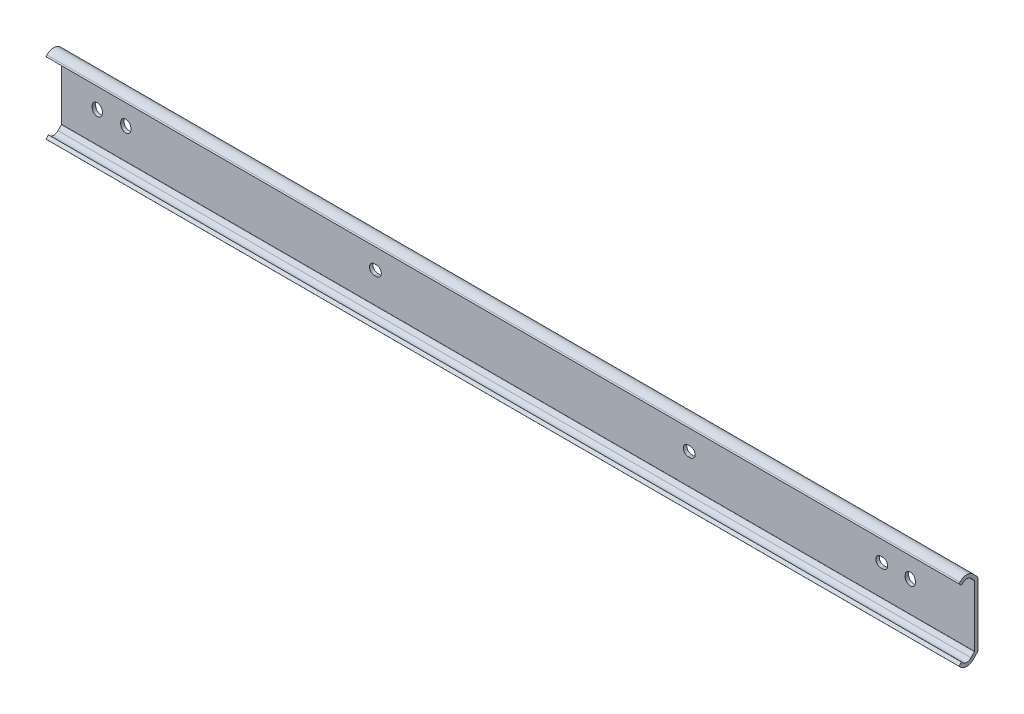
ISO-10303-21;
HEADER;
FILE_DESCRIPTION(('STEP AP214'),'2;1');
FILE_NAME('part.step','',(''),(''),'','','');
FILE_SCHEMA(('AUTOMOTIVE_DESIGN { 1 0 10303 214 1 1 1 1 }'));
ENDSEC;
DATA;
#1=APPLICATION_CONTEXT('core data for automotive mechanical design processes');
#2=APPLICATION_PROTOCOL_DEFINITION('international standard','automotive_design',2000,#1);
#3=PRODUCT_CONTEXT('',#1,'mechanical');
#4=PRODUCT('Part','Part','',(#3));
#5=PRODUCT_RELATED_PRODUCT_CATEGORY('part','',(#4));
#6=PRODUCT_DEFINITION_FORMATION('','',#4);
#7=PRODUCT_DEFINITION_CONTEXT('part definition',#1,'design');
#8=PRODUCT_DEFINITION('design','',#6,#7);
#9=PRODUCT_DEFINITION_SHAPE('','',#8);
#10=(LENGTH_UNIT() NAMED_UNIT(*) SI_UNIT(.MILLI.,.METRE.));
#11=(NAMED_UNIT(*) PLANE_ANGLE_UNIT() SI_UNIT($,.RADIAN.));
#12=(NAMED_UNIT(*) SI_UNIT($,.STERADIAN.) SOLID_ANGLE_UNIT());
#13=UNCERTAINTY_MEASURE_WITH_UNIT(LENGTH_MEASURE(1.E-05),#10,'distance_accuracy_value','');
#14=(GEOMETRIC_REPRESENTATION_CONTEXT(3) GLOBAL_UNCERTAINTY_ASSIGNED_CONTEXT((#13)) GLOBAL_UNIT_ASSIGNED_CONTEXT((#10,
#11,#12)) REPRESENTATION_CONTEXT('',''));
#15=CARTESIAN_POINT('',(0.,0.,0.));
#16=DIRECTION('',(0.,0.,1.));
#17=DIRECTION('',(1.,0.,0.));
#18=AXIS2_PLACEMENT_3D('',#15,#16,#17);
#19=CARTESIAN_POINT('',(390.5,-13.5750002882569,5.00000035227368));
#20=DIRECTION('',(-1.,0.,0.));
#21=DIRECTION('',(0.,0.,-1.));
#22=AXIS2_PLACEMENT_3D('',#19,#20,#21);
#23=CYLINDRICAL_SURFACE('',#22,2.55);
#24=CARTESIAN_POINT('',(-15.8999999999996,-13.5750002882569,5.00000035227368));
#25=DIRECTION('',(-1.,0.,0.));
#26=DIRECTION('',(0.,0.,1.));
#27=AXIS2_PLACEMENT_3D('',#24,#25,#26);
#28=CIRCLE('',#27,2.55);
#29=CARTESIAN_POINT('',(-15.8999999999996,-15.29205197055,3.11473285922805));
#30=VERTEX_POINT('',#29);
#31=CARTESIAN_POINT('',(-15.8999999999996,-15.2920940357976,6.88522953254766));
#32=VERTEX_POINT('',#31);
#33=EDGE_CURVE('E484',#30,#32,#28,.T.);
#34=ORIENTED_EDGE('',*,*,#33,.T.);
#35=DIRECTION('',(-1.,0.,0.));
#36=VECTOR('',#35,1.);
#37=CARTESIAN_POINT('',(390.5,-15.2920940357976,6.88522953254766));
#38=LINE('',#37,#36);
#39=CARTESIAN_POINT('',(390.5,-15.2920940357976,6.88522953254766));
#40=VERTEX_POINT('',#39);
#41=EDGE_CURVE('E9',#40,#32,#38,.T.);
#42=ORIENTED_EDGE('',*,*,#41,.F.);
#43=CARTESIAN_POINT('',(390.5,-13.5750002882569,5.00000035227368));
#44=DIRECTION('',(-1.,0.,0.));
#45=DIRECTION('',(0.,0.,1.));
#46=AXIS2_PLACEMENT_3D('',#43,#44,#45);
#47=CIRCLE('',#46,2.55);
#48=CARTESIAN_POINT('',(390.5,-15.29205197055,3.11473285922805));
#49=VERTEX_POINT('',#48);
#50=EDGE_CURVE('E531',#49,#40,#47,.T.);
#51=ORIENTED_EDGE('',*,*,#50,.F.);
#52=DIRECTION('',(-1.,0.,0.));
#53=VECTOR('',#52,1.);
#54=CARTESIAN_POINT('',(390.5,-15.29205197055,3.11473285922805));
#55=LINE('',#54,#53);
#56=EDGE_CURVE('E572',#49,#30,#55,.T.);
#57=ORIENTED_EDGE('',*,*,#56,.T.);
#58=EDGE_LOOP('',(#34,#42,#51,#57));
#59=FACE_BOUND('',#58,.T.);
#60=ADVANCED_FACE('F14',(#59),#23,.F.);
#61=CARTESIAN_POINT('',(390.5,-15.2920940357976,6.88522953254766));
#62=DIRECTION('',(0.,-0.692409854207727,0.721504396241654));
#63=DIRECTION('',(0.,-0.721504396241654,-0.692409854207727));
#64=AXIS2_PLACEMENT_3D('',#61,#62,#63);
#65=PLANE('',#64);
#66=DIRECTION('',(0.,0.721504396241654,0.692409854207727));
#67=VECTOR('',#66,1.);
#68=CARTESIAN_POINT('',(-15.8999999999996,-15.2920940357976,6.88522953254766));
#69=LINE('',#68,#67);
#70=CARTESIAN_POINT('',(-15.8999999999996,-14.7934626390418,7.36375370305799));
#71=VERTEX_POINT('',#70);
#72=EDGE_CURVE('E493',#32,#71,#69,.T.);
#73=ORIENTED_EDGE('',*,*,#72,.T.);
#74=DIRECTION('',(-1.,0.,0.));
#75=VECTOR('',#74,1.);
#76=CARTESIAN_POINT('',(390.5,-14.7934626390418,7.36375370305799));
#77=LINE('',#76,#75);
#78=CARTESIAN_POINT('',(390.5,-14.7934626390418,7.36375370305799));
#79=VERTEX_POINT('',#78);
#80=EDGE_CURVE('E21',#79,#71,#77,.T.);
#81=ORIENTED_EDGE('',*,*,#80,.F.);
#82=DIRECTION('',(0.,0.721504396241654,0.692409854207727));
#83=VECTOR('',#82,1.);
#84=CARTESIAN_POINT('',(390.5,-15.2920940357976,6.88522953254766));
#85=LINE('',#84,#83);
#86=EDGE_CURVE('E534',#40,#79,#85,.T.);
#87=ORIENTED_EDGE('',*,*,#86,.F.);
#88=ORIENTED_EDGE('',*,*,#41,.T.);
#89=EDGE_LOOP('',(#73,#81,#87,#88));
#90=FACE_BOUND('',#89,.T.);
#91=ADVANCED_FACE('F654',(#90),#65,.F.);
#92=CARTESIAN_POINT('',(390.5,-14.7934626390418,7.36375370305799));
#93=DIRECTION('',(0.,-0.707106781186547,-0.707106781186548));
#94=DIRECTION('',(0.,0.707106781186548,-0.707106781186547));
#95=AXIS2_PLACEMENT_3D('',#92,#93,#94);
#96=PLANE('',#95);
#97=DIRECTION('',(0.,-0.707106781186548,0.707106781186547));
#98=VECTOR('',#97,1.);
#99=CARTESIAN_POINT('',(-15.8999999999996,-14.7934626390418,7.36375370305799));
#100=LINE('',#99,#98);
#101=CARTESIAN_POINT('',(-15.8999999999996,-15.8897096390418,8.46000070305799));
#102=VERTEX_POINT('',#101);
#103=EDGE_CURVE('E495',#71,#102,#100,.T.);
#104=ORIENTED_EDGE('',*,*,#103,.T.);
#105=DIRECTION('',(-1.,0.,0.));
#106=VECTOR('',#105,1.);
#107=CARTESIAN_POINT('',(390.5,-15.8897096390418,8.46000070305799));
#108=LINE('',#107,#106);
#109=CARTESIAN_POINT('',(390.5,-15.8897096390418,8.46000070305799));
#110=VERTEX_POINT('',#109);
#111=EDGE_CURVE('E623',#110,#102,#108,.T.);
#112=ORIENTED_EDGE('',*,*,#111,.F.);
#113=DIRECTION('',(0.,-0.707106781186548,0.707106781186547));
#114=VECTOR('',#113,1.);
#115=CARTESIAN_POINT('',(390.5,-14.7934626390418,7.36375370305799));
#116=LINE('',#115,#114);
#117=EDGE_CURVE('E536',#79,#110,#116,.T.);
#118=ORIENTED_EDGE('',*,*,#117,.F.);
#119=ORIENTED_EDGE('',*,*,#80,.T.);
#120=EDGE_LOOP('',(#104,#112,#118,#119));
#121=FACE_BOUND('',#120,.T.);
#122=ADVANCED_FACE('F630',(#121),#96,.F.);
#123=CARTESIAN_POINT('',(390.5,-16.3524238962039,8.01594474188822));
#124=DIRECTION('',(0.,0.692410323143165,-0.721503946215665));
#125=DIRECTION('',(0.,0.721503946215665,0.692410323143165));
#126=AXIS2_PLACEMENT_3D('',#123,#124,#125);
#127=PLANE('',#126);
#128=DIRECTION('',(0.,-0.721503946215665,-0.692410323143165));
#129=VECTOR('',#128,1.);
#130=CARTESIAN_POINT('',(-15.8999999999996,-16.3524238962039,8.01594474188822));
#131=LINE('',#130,#129);
#132=CARTESIAN_POINT('',(-15.8999999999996,-16.3524238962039,8.01594474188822));
#133=VERTEX_POINT('',#132);
#134=EDGE_CURVE('E497',#102,#133,#131,.T.);
#135=ORIENTED_EDGE('',*,*,#134,.T.);
#136=DIRECTION('',(-1.,0.,0.));
#137=VECTOR('',#136,1.);
#138=CARTESIAN_POINT('',(390.5,-16.3524238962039,8.01594474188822));
#139=LINE('',#138,#137);
#140=CARTESIAN_POINT('',(390.5,-16.3524238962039,8.01594474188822));
#141=VERTEX_POINT('',#140);
#142=EDGE_CURVE('E620',#141,#133,#139,.T.);
#143=ORIENTED_EDGE('',*,*,#142,.F.);
#144=DIRECTION('',(0.,-0.721503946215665,-0.692410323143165));
#145=VECTOR('',#144,1.);
#146=CARTESIAN_POINT('',(390.5,-16.3524238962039,8.01594474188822));
#147=LINE('',#146,#145);
#148=EDGE_CURVE('E538',#110,#141,#147,.T.);
#149=ORIENTED_EDGE('',*,*,#148,.F.);
#150=ORIENTED_EDGE('',*,*,#111,.T.);
#151=EDGE_LOOP('',(#135,#143,#149,#150));
#152=FACE_BOUND('',#151,.T.);
#153=ADVANCED_FACE('F642',(#152),#127,.F.);
#154=CARTESIAN_POINT('',(390.5,-13.5750002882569,5.00000035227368));
#155=DIRECTION('',(-1.,0.,0.));
#156=DIRECTION('',(0.,0.,-1.));
#157=AXIS2_PLACEMENT_3D('',#154,#155,#156);
#158=CYLINDRICAL_SURFACE('',#157,4.10000029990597);
#159=CARTESIAN_POINT('',(-15.8999999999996,-13.5750002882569,5.00000035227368));
#160=DIRECTION('',(1.,0.,0.));
#161=DIRECTION('',(0.,0.,1.));
#162=AXIS2_PLACEMENT_3D('',#159,#160,#161);
#163=CIRCLE('',#162,4.10000029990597);
#164=CARTESIAN_POINT('',(-15.8999999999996,-16.4741382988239,2.10086233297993));
#165=VERTEX_POINT('',#164);
#166=EDGE_CURVE('E499',#133,#165,#163,.T.);
#167=ORIENTED_EDGE('',*,*,#166,.T.);
#168=DIRECTION('',(-1.,0.,0.));
#169=VECTOR('',#168,1.);
#170=CARTESIAN_POINT('',(390.5,-16.4741382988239,2.10086233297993));
#171=LINE('',#170,#169);
#172=CARTESIAN_POINT('',(390.5,-16.4741382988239,2.10086233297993));
#173=VERTEX_POINT('',#172);
#174=EDGE_CURVE('E617',#173,#165,#171,.T.);
#175=ORIENTED_EDGE('',*,*,#174,.F.);
#176=CARTESIAN_POINT('',(390.5,-13.5750002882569,5.00000035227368));
#177=DIRECTION('',(1.,0.,0.));
#178=DIRECTION('',(0.,0.,1.));
#179=AXIS2_PLACEMENT_3D('',#176,#177,#178);
#180=CIRCLE('',#179,4.10000029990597);
#181=EDGE_CURVE('E540',#141,#173,#180,.T.);
#182=ORIENTED_EDGE('',*,*,#181,.F.);
#183=ORIENTED_EDGE('',*,*,#142,.T.);
#184=EDGE_LOOP('',(#167,#175,#182,#183));
#185=FACE_BOUND('',#184,.T.);
#186=ADVANCED_FACE('F646',(#185),#158,.T.);
#187=CARTESIAN_POINT('',(390.5,-16.4741382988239,2.10086233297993));
#188=DIRECTION('',(0.,0.692410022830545,0.721504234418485));
#189=DIRECTION('',(0.,-0.721504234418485,0.692410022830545));
#190=AXIS2_PLACEMENT_3D('',#187,#188,#189);
#191=PLANE('',#190);
#192=DIRECTION('',(0.,0.721504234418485,-0.692410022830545));
#193=VECTOR('',#192,1.);
#194=CARTESIAN_POINT('',(-15.8999999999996,-16.4741382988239,2.10086233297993));
#195=LINE('',#194,#193);
#196=CARTESIAN_POINT('',(-15.8999999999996,-14.8073563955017,0.501292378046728));
#197=VERTEX_POINT('',#196);
#198=EDGE_CURVE('E501',#165,#197,#195,.T.);
#199=ORIENTED_EDGE('',*,*,#198,.T.);
#200=DIRECTION('',(-1.,0.,0.));
#201=VECTOR('',#200,1.);
#202=CARTESIAN_POINT('',(390.5,-14.8073563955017,0.501292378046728));
#203=LINE('',#202,#201);
#204=CARTESIAN_POINT('',(390.5,-14.8073563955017,0.501292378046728));
#205=VERTEX_POINT('',#204);
#206=EDGE_CURVE('E614',#205,#197,#203,.T.);
#207=ORIENTED_EDGE('',*,*,#206,.F.);
#208=DIRECTION('',(0.,0.721504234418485,-0.692410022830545));
#209=VECTOR('',#208,1.);
#210=CARTESIAN_POINT('',(390.5,-16.4741382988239,2.10086233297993));
#211=LINE('',#210,#209);
#212=EDGE_CURVE('E542',#173,#205,#211,.T.);
#213=ORIENTED_EDGE('',*,*,#212,.F.);
#214=ORIENTED_EDGE('',*,*,#174,.T.);
#215=EDGE_LOOP('',(#199,#207,#213,#214));
#216=FACE_BOUND('',#215,.T.);
#217=ADVANCED_FACE('F725',(#216),#191,.F.);
#218=CARTESIAN_POINT('',(390.5,-13.5610183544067,1.8));
#219=DIRECTION('',(-1.,0.,0.));
#220=DIRECTION('',(0.,0.,-1.));
#221=AXIS2_PLACEMENT_3D('',#218,#219,#220);
#222=CYLINDRICAL_SURFACE('',#221,1.8);
#223=CARTESIAN_POINT('',(-15.8999999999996,-13.5610183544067,1.8));
#224=DIRECTION('',(1.,0.,0.));
#225=DIRECTION('',(0.,0.,1.));
#226=AXIS2_PLACEMENT_3D('',#223,#224,#225);
#227=CIRCLE('',#226,1.8);
#228=CARTESIAN_POINT('',(-15.8999999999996,-13.5610183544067,0.));
#229=VERTEX_POINT('',#228);
#230=EDGE_CURVE('E503',#197,#229,#227,.T.);
#231=ORIENTED_EDGE('',*,*,#230,.T.);
#232=DIRECTION('',(-1.,0.,0.));
#233=VECTOR('',#232,1.);
#234=CARTESIAN_POINT('',(390.5,-13.5610183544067,0.));
#235=LINE('',#234,#233);
#236=CARTESIAN_POINT('',(390.5,-13.5610183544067,0.));
#237=VERTEX_POINT('',#236);
#238=EDGE_CURVE('E611',#237,#229,#235,.T.);
#239=ORIENTED_EDGE('',*,*,#238,.F.);
#240=CARTESIAN_POINT('',(390.5,-13.5610183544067,1.8));
#241=DIRECTION('',(1.,0.,0.));
#242=DIRECTION('',(0.,0.,1.));
#243=AXIS2_PLACEMENT_3D('',#240,#241,#242);
#244=CIRCLE('',#243,1.8);
#245=EDGE_CURVE('E544',#205,#237,#244,.T.);
#246=ORIENTED_EDGE('',*,*,#245,.F.);
#247=ORIENTED_EDGE('',*,*,#206,.T.);
#248=EDGE_LOOP('',(#231,#239,#246,#247));
#249=FACE_BOUND('',#248,.T.);
#250=ADVANCED_FACE('F723',(#249),#222,.T.);
#251=CARTESIAN_POINT('',(390.5,13.5610177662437,0.));
#252=DIRECTION('',(0.,0.,1.));
#253=DIRECTION('',(-1.,0.,0.));
#254=AXIS2_PLACEMENT_3D('',#251,#252,#253);
#255=PLANE('',#254);
#256=DIRECTION('',(0.,1.,0.));
#257=VECTOR('',#256,1.);
#258=CARTESIAN_POINT('',(14.95,-0.399999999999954,0.));
#259=LINE('',#258,#257);
#260=CARTESIAN_POINT('',(14.95,-0.399999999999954,0.));
#261=VERTEX_POINT('',#260);
#262=CARTESIAN_POINT('',(14.95,0.399999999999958,0.));
#263=VERTEX_POINT('',#262);
#264=EDGE_CURVE('E323',#261,#263,#259,.T.);
#265=ORIENTED_EDGE('',*,*,#264,.T.);
#266=CARTESIAN_POINT('',(12.7000000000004,0.399999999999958,0.));
#267=DIRECTION('',(0.,0.,1.));
#268=DIRECTION('',(-1.,0.,0.));
#269=AXIS2_PLACEMENT_3D('',#266,#267,#268);
#270=CIRCLE('',#269,2.24999999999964);
#271=CARTESIAN_POINT('',(10.4500000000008,0.399999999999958,0.));
#272=VERTEX_POINT('',#271);
#273=EDGE_CURVE('E314',#263,#272,#270,.T.);
#274=ORIENTED_EDGE('',*,*,#273,.T.);
#275=DIRECTION('',(0.,-1.,0.));
#276=VECTOR('',#275,1.);
#277=CARTESIAN_POINT('',(10.4500000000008,-0.399999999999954,0.));
#278=LINE('',#277,#276);
#279=CARTESIAN_POINT('',(10.4500000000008,-0.399999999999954,0.));
#280=VERTEX_POINT('',#279);
#281=EDGE_CURVE('E320',#272,#280,#278,.T.);
#282=ORIENTED_EDGE('',*,*,#281,.T.);
#283=CARTESIAN_POINT('',(12.7000000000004,-0.399999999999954,0.));
#284=DIRECTION('',(0.,0.,1.));
#285=DIRECTION('',(-1.,0.,0.));
#286=AXIS2_PLACEMENT_3D('',#283,#284,#285);
#287=CIRCLE('',#286,2.24999999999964);
#288=EDGE_CURVE('E28',#280,#261,#287,.T.);
#289=ORIENTED_EDGE('',*,*,#288,.T.);
#290=EDGE_LOOP('',(#265,#274,#282,#289));
#291=FACE_BOUND('',#290,.T.);
#292=DIRECTION('',(0.,-1.,0.));
#293=VECTOR('',#292,1.);
#294=CARTESIAN_POINT('',(-2.24999999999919,-0.399999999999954,0.));
#295=LINE('',#294,#293);
#296=CARTESIAN_POINT('',(-2.24999999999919,0.399999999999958,0.));
#297=VERTEX_POINT('',#296);
#298=CARTESIAN_POINT('',(-2.24999999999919,-0.399999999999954,0.));
#299=VERTEX_POINT('',#298);
#300=EDGE_CURVE('E350',#297,#299,#295,.T.);
#301=ORIENTED_EDGE('',*,*,#300,.T.);
#302=CARTESIAN_POINT('',(4.02455846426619E-13,-0.399999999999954,0.));
#303=DIRECTION('',(0.,0.,1.));
#304=DIRECTION('',(-1.,0.,0.));
#305=AXIS2_PLACEMENT_3D('',#302,#303,#304);
#306=CIRCLE('',#305,2.24999999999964);
#307=CARTESIAN_POINT('',(2.25000000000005,-0.399999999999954,0.));
#308=VERTEX_POINT('',#307);
#309=EDGE_CURVE('E341',#299,#308,#306,.T.);
#310=ORIENTED_EDGE('',*,*,#309,.T.);
#311=DIRECTION('',(0.,1.,0.));
#312=VECTOR('',#311,1.);
#313=CARTESIAN_POINT('',(2.25000000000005,-0.399999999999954,0.));
#314=LINE('',#313,#312);
#315=CARTESIAN_POINT('',(2.25000000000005,0.399999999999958,0.));
#316=VERTEX_POINT('',#315);
#317=EDGE_CURVE('E344',#308,#316,#314,.T.);
#318=ORIENTED_EDGE('',*,*,#317,.T.);
#319=CARTESIAN_POINT('',(4.02455846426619E-13,0.399999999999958,0.));
#320=DIRECTION('',(0.,0.,1.));
#321=DIRECTION('',(-1.,0.,0.));
#322=AXIS2_PLACEMENT_3D('',#319,#320,#321);
#323=CIRCLE('',#322,2.24999999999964);
#324=EDGE_CURVE('E347',#316,#297,#323,.T.);
#325=ORIENTED_EDGE('',*,*,#324,.T.);
#326=EDGE_LOOP('',(#301,#310,#318,#325));
#327=FACE_BOUND('',#326,.T.);
#328=DIRECTION('',(1.,0.,0.));
#329=VECTOR('',#328,1.);
#330=CARTESIAN_POINT('',(124.200336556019,-2.24999827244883,0.));
#331=LINE('',#330,#329);
#332=CARTESIAN_POINT('',(123.40033655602,-2.24999827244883,0.));
#333=VERTEX_POINT('',#332);
#334=CARTESIAN_POINT('',(124.200336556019,-2.24999827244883,0.));
#335=VERTEX_POINT('',#334);
#336=EDGE_CURVE('E382',#333,#335,#331,.T.);
#337=ORIENTED_EDGE('',*,*,#336,.T.);
#338=CARTESIAN_POINT('',(124.200336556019,1.72755114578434E-06,0.));
#339=DIRECTION('',(0.,0.,1.));
#340=DIRECTION('',(-1.,0.,0.));
#341=AXIS2_PLACEMENT_3D('',#338,#339,#340);
#342=CIRCLE('',#341,2.24999999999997);
#343=CARTESIAN_POINT('',(124.200336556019,2.25000172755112,0.));
#344=VERTEX_POINT('',#343);
#345=EDGE_CURVE('E373',#335,#344,#342,.T.);
#346=ORIENTED_EDGE('',*,*,#345,.T.);
#347=DIRECTION('',(-1.,0.,0.));
#348=VECTOR('',#347,1.);
#349=CARTESIAN_POINT('',(124.200336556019,2.25000172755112,0.));
#350=LINE('',#349,#348);
#351=CARTESIAN_POINT('',(123.40033655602,2.25000172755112,0.));
#352=VERTEX_POINT('',#351);
#353=EDGE_CURVE('E376',#344,#352,#350,.T.);
#354=ORIENTED_EDGE('',*,*,#353,.T.);
#355=CARTESIAN_POINT('',(123.40033655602,1.72755114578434E-06,0.));
#356=DIRECTION('',(0.,0.,1.));
#357=DIRECTION('',(-1.,0.,0.));
#358=AXIS2_PLACEMENT_3D('',#355,#356,#357);
#359=CIRCLE('',#358,2.24999999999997);
#360=EDGE_CURVE('E379',#352,#333,#359,.T.);
#361=ORIENTED_EDGE('',*,*,#360,.T.);
#362=EDGE_LOOP('',(#337,#346,#354,#361));
#363=FACE_BOUND('',#362,.T.);
#364=DIRECTION('',(1.,-1.05167610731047E-13,0.));
#365=VECTOR('',#364,1.);
#366=CARTESIAN_POINT('',(263.9,-2.25,0.));
#367=LINE('',#366,#365);
#368=CARTESIAN_POINT('',(263.1,-2.24999999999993,0.));
#369=VERTEX_POINT('',#368);
#370=CARTESIAN_POINT('',(263.9,-2.25,0.));
#371=VERTEX_POINT('',#370);
#372=EDGE_CURVE('E414',#369,#371,#367,.T.);
#373=ORIENTED_EDGE('',*,*,#372,.T.);
#374=CARTESIAN_POINT('',(263.9,0.,0.));
#375=DIRECTION('',(0.,0.,1.));
#376=DIRECTION('',(-1.,0.,0.));
#377=AXIS2_PLACEMENT_3D('',#374,#375,#376);
#378=CIRCLE('',#377,2.24999999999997);
#379=CARTESIAN_POINT('',(263.9,2.24999999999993,0.));
#380=VERTEX_POINT('',#379);
#381=EDGE_CURVE('E405',#371,#380,#378,.T.);
#382=ORIENTED_EDGE('',*,*,#381,.T.);
#383=DIRECTION('',(-1.,0.,0.));
#384=VECTOR('',#383,1.);
#385=CARTESIAN_POINT('',(263.9,2.24999999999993,0.));
#386=LINE('',#385,#384);
#387=CARTESIAN_POINT('',(263.1,2.24999999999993,0.));
#388=VERTEX_POINT('',#387);
#389=EDGE_CURVE('E408',#380,#388,#386,.T.);
#390=ORIENTED_EDGE('',*,*,#389,.T.);
#391=CARTESIAN_POINT('',(263.1,0.,0.));
#392=DIRECTION('',(0.,0.,1.));
#393=DIRECTION('',(-1.,0.,0.));
#394=AXIS2_PLACEMENT_3D('',#391,#392,#393);
#395=CIRCLE('',#394,2.24999999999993);
#396=EDGE_CURVE('E411',#388,#369,#395,.T.);
#397=ORIENTED_EDGE('',*,*,#396,.T.);
#398=EDGE_LOOP('',(#373,#382,#390,#397));
#399=FACE_BOUND('',#398,.T.);
#400=DIRECTION('',(1.,0.,0.));
#401=VECTOR('',#400,1.);
#402=CARTESIAN_POINT('',(349.6,-2.25,0.));
#403=LINE('',#402,#401);
#404=CARTESIAN_POINT('',(348.8,-2.24999999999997,0.));
#405=VERTEX_POINT('',#404);
#406=CARTESIAN_POINT('',(349.6,-2.25,0.));
#407=VERTEX_POINT('',#406);
#408=EDGE_CURVE('E446',#405,#407,#403,.T.);
#409=ORIENTED_EDGE('',*,*,#408,.T.);
#410=CARTESIAN_POINT('',(349.6,0.,0.));
#411=DIRECTION('',(0.,0.,1.));
#412=DIRECTION('',(-1.,0.,0.));
#413=AXIS2_PLACEMENT_3D('',#410,#411,#412);
#414=CIRCLE('',#413,2.24999999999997);
#415=CARTESIAN_POINT('',(349.6,2.24999999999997,0.));
#416=VERTEX_POINT('',#415);
#417=EDGE_CURVE('E437',#407,#416,#414,.T.);
#418=ORIENTED_EDGE('',*,*,#417,.T.);
#419=DIRECTION('',(-1.,0.,0.));
#420=VECTOR('',#419,1.);
#421=CARTESIAN_POINT('',(349.6,2.24999999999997,0.));
#422=LINE('',#421,#420);
#423=CARTESIAN_POINT('',(348.8,2.24999999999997,0.));
#424=VERTEX_POINT('',#423);
#425=EDGE_CURVE('E440',#416,#424,#422,.T.);
#426=ORIENTED_EDGE('',*,*,#425,.T.);
#427=CARTESIAN_POINT('',(348.8,0.,0.));
#428=DIRECTION('',(0.,0.,1.));
#429=DIRECTION('',(-1.,0.,0.));
#430=AXIS2_PLACEMENT_3D('',#427,#428,#429);
#431=CIRCLE('',#430,2.24999999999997);
#432=EDGE_CURVE('E443',#424,#405,#431,.T.);
#433=ORIENTED_EDGE('',*,*,#432,.T.);
#434=EDGE_LOOP('',(#409,#418,#426,#433));
#435=FACE_BOUND('',#434,.T.);
#436=DIRECTION('',(0.,1.,0.));
#437=VECTOR('',#436,1.);
#438=CARTESIAN_POINT('',(364.15,-0.399999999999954,0.));
#439=LINE('',#438,#437);
#440=CARTESIAN_POINT('',(364.15,-0.399999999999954,0.));
#441=VERTEX_POINT('',#440);
#442=CARTESIAN_POINT('',(364.15,0.399999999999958,0.));
#443=VERTEX_POINT('',#442);
#444=EDGE_CURVE('E478',#441,#443,#439,.T.);
#445=ORIENTED_EDGE('',*,*,#444,.T.);
#446=CARTESIAN_POINT('',(361.9,0.399999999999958,0.));
#447=DIRECTION('',(0.,0.,1.));
#448=DIRECTION('',(-1.,0.,0.));
#449=AXIS2_PLACEMENT_3D('',#446,#447,#448);
#450=CIRCLE('',#449,2.24999999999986);
#451=CARTESIAN_POINT('',(359.65,0.399999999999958,0.));
#452=VERTEX_POINT('',#451);
#453=EDGE_CURVE('E469',#443,#452,#450,.T.);
#454=ORIENTED_EDGE('',*,*,#453,.T.);
#455=DIRECTION('',(0.,-1.,0.));
#456=VECTOR('',#455,1.);
#457=CARTESIAN_POINT('',(359.65,-0.399999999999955,0.));
#458=LINE('',#457,#456);
#459=CARTESIAN_POINT('',(359.65,-0.399999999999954,0.));
#460=VERTEX_POINT('',#459);
#461=EDGE_CURVE('E472',#452,#460,#458,.T.);
#462=ORIENTED_EDGE('',*,*,#461,.T.);
#463=CARTESIAN_POINT('',(361.9,-0.399999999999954,0.));
#464=DIRECTION('',(0.,0.,1.));
#465=DIRECTION('',(-1.,0.,0.));
#466=AXIS2_PLACEMENT_3D('',#463,#464,#465);
#467=CIRCLE('',#466,2.24999999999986);
#468=EDGE_CURVE('E475',#460,#441,#467,.T.);
#469=ORIENTED_EDGE('',*,*,#468,.T.);
#470=EDGE_LOOP('',(#445,#454,#462,#469));
#471=FACE_BOUND('',#470,.T.);
#472=DIRECTION('',(0.,1.,0.));
#473=VECTOR('',#472,1.);
#474=CARTESIAN_POINT('',(-15.8999999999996,13.5610177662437,0.));
#475=LINE('',#474,#473);
#476=CARTESIAN_POINT('',(-15.8999999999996,13.5610177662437,0.));
#477=VERTEX_POINT('',#476);
#478=EDGE_CURVE('E505',#229,#477,#475,.T.);
#479=ORIENTED_EDGE('',*,*,#478,.T.);
#480=DIRECTION('',(-1.,0.,0.));
#481=VECTOR('',#480,1.);
#482=CARTESIAN_POINT('',(390.5,13.5610177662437,0.));
#483=LINE('',#482,#481);
#484=CARTESIAN_POINT('',(390.5,13.5610177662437,0.));
#485=VERTEX_POINT('',#484);
#486=EDGE_CURVE('E608',#485,#477,#483,.T.);
#487=ORIENTED_EDGE('',*,*,#486,.F.);
#488=DIRECTION('',(0.,1.,0.));
#489=VECTOR('',#488,1.);
#490=CARTESIAN_POINT('',(390.5,13.5610177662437,0.));
#491=LINE('',#490,#489);
#492=EDGE_CURVE('E546',#237,#485,#491,.T.);
#493=ORIENTED_EDGE('',*,*,#492,.F.);
#494=ORIENTED_EDGE('',*,*,#238,.T.);
#495=EDGE_LOOP('',(#479,#487,#493,#494));
#496=FACE_BOUND('',#495,.T.);
#497=ADVANCED_FACE('F718',(#291,#327,#363,#399,#435,#471,#496),#255,.F.);
#498=CARTESIAN_POINT('',(390.5,13.5610177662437,1.8));
#499=DIRECTION('',(-1.,0.,0.));
#500=DIRECTION('',(0.,0.,-1.));
#501=AXIS2_PLACEMENT_3D('',#498,#499,#500);
#502=CYLINDRICAL_SURFACE('',#501,1.8);
#503=CARTESIAN_POINT('',(-15.8999999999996,13.5610177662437,1.8));
#504=DIRECTION('',(1.,0.,0.));
#505=DIRECTION('',(0.,0.,-1.));
#506=AXIS2_PLACEMENT_3D('',#503,#504,#505);
#507=CIRCLE('',#506,1.8);
#508=CARTESIAN_POINT('',(-15.8999999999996,14.8073558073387,0.501292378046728));
#509=VERTEX_POINT('',#508);
#510=EDGE_CURVE('E507',#477,#509,#507,.T.);
#511=ORIENTED_EDGE('',*,*,#510,.T.);
#512=DIRECTION('',(-1.,0.,0.));
#513=VECTOR('',#512,1.);
#514=CARTESIAN_POINT('',(390.5,14.8073558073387,0.501292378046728));
#515=LINE('',#514,#513);
#516=CARTESIAN_POINT('',(390.5,14.8073558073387,0.501292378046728));
#517=VERTEX_POINT('',#516);
#518=EDGE_CURVE('E605',#517,#509,#515,.T.);
#519=ORIENTED_EDGE('',*,*,#518,.F.);
#520=CARTESIAN_POINT('',(390.5,13.5610177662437,1.8));
#521=DIRECTION('',(1.,0.,0.));
#522=DIRECTION('',(0.,0.,-1.));
#523=AXIS2_PLACEMENT_3D('',#520,#521,#522);
#524=CIRCLE('',#523,1.8);
#525=EDGE_CURVE('E548',#485,#517,#524,.T.);
#526=ORIENTED_EDGE('',*,*,#525,.F.);
#527=ORIENTED_EDGE('',*,*,#486,.T.);
#528=EDGE_LOOP('',(#511,#519,#526,#527));
#529=FACE_BOUND('',#528,.T.);
#530=ADVANCED_FACE('F713',(#529),#502,.T.);
#531=CARTESIAN_POINT('',(390.5,16.474137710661,2.10086233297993));
#532=DIRECTION('',(0.,-0.692410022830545,0.721504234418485));
#533=DIRECTION('',(0.,-0.721504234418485,-0.692410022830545));
#534=AXIS2_PLACEMENT_3D('',#531,#532,#533);
#535=PLANE('',#534);
#536=DIRECTION('',(0.,0.721504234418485,0.692410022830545));
#537=VECTOR('',#536,1.);
#538=CARTESIAN_POINT('',(-15.8999999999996,16.474137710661,2.10086233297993));
#539=LINE('',#538,#537);
#540=CARTESIAN_POINT('',(-15.8999999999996,16.474137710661,2.10086233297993));
#541=VERTEX_POINT('',#540);
#542=EDGE_CURVE('E509',#509,#541,#539,.T.);
#543=ORIENTED_EDGE('',*,*,#542,.T.);
#544=DIRECTION('',(-1.,0.,0.));
#545=VECTOR('',#544,1.);
#546=CARTESIAN_POINT('',(390.5,16.474137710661,2.10086233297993));
#547=LINE('',#546,#545);
#548=CARTESIAN_POINT('',(390.5,16.474137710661,2.10086233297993));
#549=VERTEX_POINT('',#548);
#550=EDGE_CURVE('E602',#549,#541,#547,.T.);
#551=ORIENTED_EDGE('',*,*,#550,.F.);
#552=DIRECTION('',(0.,0.721504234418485,0.692410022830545));
#553=VECTOR('',#552,1.);
#554=CARTESIAN_POINT('',(390.5,16.474137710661,2.10086233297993));
#555=LINE('',#554,#553);
#556=EDGE_CURVE('E550',#517,#549,#555,.T.);
#557=ORIENTED_EDGE('',*,*,#556,.F.);
#558=ORIENTED_EDGE('',*,*,#518,.T.);
#559=EDGE_LOOP('',(#543,#551,#557,#558));
#560=FACE_BOUND('',#559,.T.);
#561=ADVANCED_FACE('F709',(#560),#535,.F.);
#562=CARTESIAN_POINT('',(390.5,13.5749997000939,5.00000035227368));
#563=DIRECTION('',(-1.,0.,0.));
#564=DIRECTION('',(0.,0.,-1.));
#565=AXIS2_PLACEMENT_3D('',#562,#563,#564);
#566=CYLINDRICAL_SURFACE('',#565,4.10000029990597);
#567=CARTESIAN_POINT('',(-15.8999999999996,13.5749997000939,5.00000035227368));
#568=DIRECTION('',(1.,0.,0.));
#569=DIRECTION('',(0.,0.,-1.));
#570=AXIS2_PLACEMENT_3D('',#567,#568,#569);
#571=CIRCLE('',#570,4.10000029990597);
#572=CARTESIAN_POINT('',(-15.8999999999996,16.3524233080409,8.01594474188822));
#573=VERTEX_POINT('',#572);
#574=EDGE_CURVE('E511',#541,#573,#571,.T.);
#575=ORIENTED_EDGE('',*,*,#574,.T.);
#576=DIRECTION('',(-1.,0.,0.));
#577=VECTOR('',#576,1.);
#578=CARTESIAN_POINT('',(390.5,16.3524233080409,8.01594474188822));
#579=LINE('',#578,#577);
#580=CARTESIAN_POINT('',(390.5,16.3524233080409,8.01594474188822));
#581=VERTEX_POINT('',#580);
#582=EDGE_CURVE('E599',#581,#573,#579,.T.);
#583=ORIENTED_EDGE('',*,*,#582,.F.);
#584=CARTESIAN_POINT('',(390.5,13.5749997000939,5.00000035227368));
#585=DIRECTION('',(1.,0.,0.));
#586=DIRECTION('',(0.,0.,-1.));
#587=AXIS2_PLACEMENT_3D('',#584,#585,#586);
#588=CIRCLE('',#587,4.10000029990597);
#589=EDGE_CURVE('E552',#549,#581,#588,.T.);
#590=ORIENTED_EDGE('',*,*,#589,.F.);
#591=ORIENTED_EDGE('',*,*,#550,.T.);
#592=EDGE_LOOP('',(#575,#583,#590,#591));
#593=FACE_BOUND('',#592,.T.);
#594=ADVANCED_FACE('F704',(#593),#566,.T.);
#595=CARTESIAN_POINT('',(390.5,16.3524233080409,8.01594474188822));
#596=DIRECTION('',(0.,-0.692410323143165,-0.721503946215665));
#597=DIRECTION('',(0.,0.721503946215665,-0.692410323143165));
#598=AXIS2_PLACEMENT_3D('',#595,#596,#597);
#599=PLANE('',#598);
#600=DIRECTION('',(0.,-0.721503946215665,0.692410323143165));
#601=VECTOR('',#600,1.);
#602=CARTESIAN_POINT('',(-15.8999999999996,16.3524233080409,8.01594474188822));
#603=LINE('',#602,#601);
#604=CARTESIAN_POINT('',(-15.8999999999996,15.8897090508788,8.46000070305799));
#605=VERTEX_POINT('',#604);
#606=EDGE_CURVE('E513',#573,#605,#603,.T.);
#607=ORIENTED_EDGE('',*,*,#606,.T.);
#608=DIRECTION('',(-1.,0.,0.));
#609=VECTOR('',#608,1.);
#610=CARTESIAN_POINT('',(390.5,15.8897090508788,8.46000070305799));
#611=LINE('',#610,#609);
#612=CARTESIAN_POINT('',(390.5,15.8897090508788,8.46000070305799));
#613=VERTEX_POINT('',#612);
#614=EDGE_CURVE('E596',#613,#605,#611,.T.);
#615=ORIENTED_EDGE('',*,*,#614,.F.);
#616=DIRECTION('',(0.,-0.721503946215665,0.692410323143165));
#617=VECTOR('',#616,1.);
#618=CARTESIAN_POINT('',(390.5,16.3524233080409,8.01594474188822));
#619=LINE('',#618,#617);
#620=EDGE_CURVE('E554',#581,#613,#619,.T.);
#621=ORIENTED_EDGE('',*,*,#620,.F.);
#622=ORIENTED_EDGE('',*,*,#582,.T.);
#623=EDGE_LOOP('',(#607,#615,#621,#622));
#624=FACE_BOUND('',#623,.T.);
#625=ADVANCED_FACE('F698',(#624),#599,.F.);
#626=CARTESIAN_POINT('',(390.5,14.7934620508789,7.36375370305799));
#627=DIRECTION('',(0.,0.707106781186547,-0.707106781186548));
#628=DIRECTION('',(0.,0.707106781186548,0.707106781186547));
#629=AXIS2_PLACEMENT_3D('',#626,#627,#628);
#630=PLANE('',#629);
#631=DIRECTION('',(0.,-0.707106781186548,-0.707106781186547));
#632=VECTOR('',#631,1.);
#633=CARTESIAN_POINT('',(-15.8999999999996,14.7934620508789,7.36375370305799));
#634=LINE('',#633,#632);
#635=CARTESIAN_POINT('',(-15.8999999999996,14.7934620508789,7.36375370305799));
#636=VERTEX_POINT('',#635);
#637=EDGE_CURVE('E515',#605,#636,#634,.T.);
#638=ORIENTED_EDGE('',*,*,#637,.T.);
#639=DIRECTION('',(-1.,0.,0.));
#640=VECTOR('',#639,1.);
#641=CARTESIAN_POINT('',(390.5,14.7934620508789,7.36375370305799));
#642=LINE('',#641,#640);
#643=CARTESIAN_POINT('',(390.5,14.7934620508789,7.36375370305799));
#644=VERTEX_POINT('',#643);
#645=EDGE_CURVE('E593',#644,#636,#642,.T.);
#646=ORIENTED_EDGE('',*,*,#645,.F.);
#647=DIRECTION('',(0.,-0.707106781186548,-0.707106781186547));
#648=VECTOR('',#647,1.);
#649=CARTESIAN_POINT('',(390.5,14.7934620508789,7.36375370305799));
#650=LINE('',#649,#648);
#651=EDGE_CURVE('E556',#613,#644,#650,.T.);
#652=ORIENTED_EDGE('',*,*,#651,.F.);
#653=ORIENTED_EDGE('',*,*,#614,.T.);
#654=EDGE_LOOP('',(#638,#646,#652,#653));
#655=FACE_BOUND('',#654,.T.);
#656=ADVANCED_FACE('F694',(#655),#630,.F.);
#657=CARTESIAN_POINT('',(390.5,15.2920934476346,6.88522953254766));
#658=DIRECTION('',(0.,0.692409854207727,0.721504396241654));
#659=DIRECTION('',(0.,-0.721504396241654,0.692409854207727));
#660=AXIS2_PLACEMENT_3D('',#657,#658,#659);
#661=PLANE('',#660);
#662=DIRECTION('',(0.,0.721504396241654,-0.692409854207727));
#663=VECTOR('',#662,1.);
#664=CARTESIAN_POINT('',(-15.8999999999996,15.2920934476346,6.88522953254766));
#665=LINE('',#664,#663);
#666=CARTESIAN_POINT('',(-15.8999999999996,15.2920934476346,6.88522953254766));
#667=VERTEX_POINT('',#666);
#668=EDGE_CURVE('E517',#636,#667,#665,.T.);
#669=ORIENTED_EDGE('',*,*,#668,.T.);
#670=DIRECTION('',(-1.,0.,0.));
#671=VECTOR('',#670,1.);
#672=CARTESIAN_POINT('',(390.5,15.2920934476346,6.88522953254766));
#673=LINE('',#672,#671);
#674=CARTESIAN_POINT('',(390.5,15.2920934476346,6.88522953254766));
#675=VERTEX_POINT('',#674);
#676=EDGE_CURVE('E590',#675,#667,#673,.T.);
#677=ORIENTED_EDGE('',*,*,#676,.F.);
#678=DIRECTION('',(0.,0.721504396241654,-0.692409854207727));
#679=VECTOR('',#678,1.);
#680=CARTESIAN_POINT('',(390.5,15.2920934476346,6.88522953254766));
#681=LINE('',#680,#679);
#682=EDGE_CURVE('E558',#644,#675,#681,.T.);
#683=ORIENTED_EDGE('',*,*,#682,.F.);
#684=ORIENTED_EDGE('',*,*,#645,.T.);
#685=EDGE_LOOP('',(#669,#677,#683,#684));
#686=FACE_BOUND('',#685,.T.);
#687=ADVANCED_FACE('F689',(#686),#661,.F.);
#688=CARTESIAN_POINT('',(390.5,13.5749997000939,5.00000035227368));
#689=DIRECTION('',(-1.,0.,0.));
#690=DIRECTION('',(0.,0.,-1.));
#691=AXIS2_PLACEMENT_3D('',#688,#689,#690);
#692=CYLINDRICAL_SURFACE('',#691,2.55);
#693=CARTESIAN_POINT('',(-15.8999999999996,13.5749997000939,5.00000035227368));
#694=DIRECTION('',(-1.,0.,0.));
#695=DIRECTION('',(0.,0.,-1.));
#696=AXIS2_PLACEMENT_3D('',#693,#694,#695);
#697=CIRCLE('',#696,2.55);
#698=CARTESIAN_POINT('',(-15.8999999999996,15.292051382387,3.11473285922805));
#699=VERTEX_POINT('',#698);
#700=EDGE_CURVE('E519',#667,#699,#697,.T.);
#701=ORIENTED_EDGE('',*,*,#700,.T.);
#702=DIRECTION('',(-1.,0.,0.));
#703=VECTOR('',#702,1.);
#704=CARTESIAN_POINT('',(390.5,15.292051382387,3.11473285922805));
#705=LINE('',#704,#703);
#706=CARTESIAN_POINT('',(390.5,15.292051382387,3.11473285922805));
#707=VERTEX_POINT('',#706);
#708=EDGE_CURVE('E587',#707,#699,#705,.T.);
#709=ORIENTED_EDGE('',*,*,#708,.F.);
#710=CARTESIAN_POINT('',(390.5,13.5749997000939,5.00000035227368));
#711=DIRECTION('',(-1.,0.,0.));
#712=DIRECTION('',(0.,0.,-1.));
#713=AXIS2_PLACEMENT_3D('',#710,#711,#712);
#714=CIRCLE('',#713,2.55);
#715=EDGE_CURVE('E560',#675,#707,#714,.T.);
#716=ORIENTED_EDGE('',*,*,#715,.F.);
#717=ORIENTED_EDGE('',*,*,#676,.T.);
#718=EDGE_LOOP('',(#701,#709,#716,#717));
#719=FACE_BOUND('',#718,.T.);
#720=ADVANCED_FACE('F683',(#719),#692,.F.);
#721=CARTESIAN_POINT('',(390.5,15.292051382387,3.11473285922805));
#722=DIRECTION('',(0.,0.692410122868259,-0.721504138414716));
#723=DIRECTION('',(0.,0.721504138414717,0.692410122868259));
#724=AXIS2_PLACEMENT_3D('',#721,#722,#723);
#725=PLANE('',#724);
#726=DIRECTION('',(0.,-0.721504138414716,-0.692410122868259));
#727=VECTOR('',#726,1.);
#728=CARTESIAN_POINT('',(-15.8999999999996,15.292051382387,3.11473285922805));
#729=LINE('',#728,#727);
#730=CARTESIAN_POINT('',(-15.8999999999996,13.7341202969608,1.61962396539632));
#731=VERTEX_POINT('',#730);
#732=EDGE_CURVE('E521',#699,#731,#729,.T.);
#733=ORIENTED_EDGE('',*,*,#732,.T.);
#734=DIRECTION('',(-1.,0.,0.));
#735=VECTOR('',#734,1.);
#736=CARTESIAN_POINT('',(390.5,13.7341202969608,1.61962396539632));
#737=LINE('',#736,#735);
#738=CARTESIAN_POINT('',(390.5,13.7341202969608,1.61962396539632));
#739=VERTEX_POINT('',#738);
#740=EDGE_CURVE('E584',#739,#731,#737,.T.);
#741=ORIENTED_EDGE('',*,*,#740,.F.);
#742=DIRECTION('',(0.,-0.721504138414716,-0.692410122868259));
#743=VECTOR('',#742,1.);
#744=CARTESIAN_POINT('',(390.5,15.292051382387,3.11473285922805));
#745=LINE('',#744,#743);
#746=EDGE_CURVE('E562',#707,#739,#745,.T.);
#747=ORIENTED_EDGE('',*,*,#746,.F.);
#748=ORIENTED_EDGE('',*,*,#708,.T.);
#749=EDGE_LOOP('',(#733,#741,#747,#748));
#750=FACE_BOUND('',#749,.T.);
#751=ADVANCED_FACE('F679',(#750),#725,.F.);
#752=CARTESIAN_POINT('',(390.5,13.5610177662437,1.8));
#753=DIRECTION('',(-1.,0.,0.));
#754=DIRECTION('',(0.,0.,-1.));
#755=AXIS2_PLACEMENT_3D('',#752,#753,#754);
#756=CYLINDRICAL_SURFACE('',#755,0.249999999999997);
#757=CARTESIAN_POINT('',(-15.8999999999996,13.5610177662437,1.8));
#758=DIRECTION('',(-1.,0.,0.));
#759=DIRECTION('',(0.,0.,1.));
#760=AXIS2_PLACEMENT_3D('',#757,#758,#759);
#761=CIRCLE('',#760,0.249999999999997);
#762=CARTESIAN_POINT('',(-15.8999999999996,13.5610177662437,1.55));
#763=VERTEX_POINT('',#762);
#764=EDGE_CURVE('E523',#731,#763,#761,.T.);
#765=ORIENTED_EDGE('',*,*,#764,.T.);
#766=DIRECTION('',(-1.,0.,0.));
#767=VECTOR('',#766,1.);
#768=CARTESIAN_POINT('',(390.5,13.5610177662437,1.55));
#769=LINE('',#768,#767);
#770=CARTESIAN_POINT('',(390.5,13.5610177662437,1.55));
#771=VERTEX_POINT('',#770);
#772=EDGE_CURVE('E581',#771,#763,#769,.T.);
#773=ORIENTED_EDGE('',*,*,#772,.F.);
#774=CARTESIAN_POINT('',(390.5,13.5610177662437,1.8));
#775=DIRECTION('',(-1.,0.,0.));
#776=DIRECTION('',(0.,0.,1.));
#777=AXIS2_PLACEMENT_3D('',#774,#775,#776);
#778=CIRCLE('',#777,0.249999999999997);
#779=EDGE_CURVE('E564',#739,#771,#778,.T.);
#780=ORIENTED_EDGE('',*,*,#779,.F.);
#781=ORIENTED_EDGE('',*,*,#740,.T.);
#782=EDGE_LOOP('',(#765,#773,#780,#781));
#783=FACE_BOUND('',#782,.T.);
#784=ADVANCED_FACE('F674',(#783),#756,.F.);
#785=CARTESIAN_POINT('',(390.5,13.5610177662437,1.55));
#786=DIRECTION('',(0.,0.,-1.));
#787=DIRECTION('',(1.,0.,0.));
#788=AXIS2_PLACEMENT_3D('',#785,#786,#787);
#789=PLANE('',#788);
#790=DIRECTION('',(0.,-1.,0.));
#791=VECTOR('',#790,1.);
#792=CARTESIAN_POINT('',(10.4500000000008,-0.399999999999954,1.55));
#793=LINE('',#792,#791);
#794=CARTESIAN_POINT('',(10.4500000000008,0.399999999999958,1.55));
#795=VERTEX_POINT('',#794);
#796=CARTESIAN_POINT('',(10.4500000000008,-0.399999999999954,1.55));
#797=VERTEX_POINT('',#796);
#798=EDGE_CURVE('E305',#795,#797,#793,.T.);
#799=ORIENTED_EDGE('',*,*,#798,.F.);
#800=CARTESIAN_POINT('',(12.7000000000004,0.399999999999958,1.55));
#801=DIRECTION('',(0.,0.,1.));
#802=DIRECTION('',(-1.,0.,0.));
#803=AXIS2_PLACEMENT_3D('',#800,#801,#802);
#804=CIRCLE('',#803,2.24999999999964);
#805=CARTESIAN_POINT('',(14.95,0.399999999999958,1.55));
#806=VERTEX_POINT('',#805);
#807=EDGE_CURVE('E36',#806,#795,#804,.T.);
#808=ORIENTED_EDGE('',*,*,#807,.F.);
#809=DIRECTION('',(0.,1.,0.));
#810=VECTOR('',#809,1.);
#811=CARTESIAN_POINT('',(14.95,-0.399999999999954,1.55));
#812=LINE('',#811,#810);
#813=CARTESIAN_POINT('',(14.95,-0.399999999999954,1.55));
#814=VERTEX_POINT('',#813);
#815=EDGE_CURVE('E312',#814,#806,#812,.T.);
#816=ORIENTED_EDGE('',*,*,#815,.F.);
#817=CARTESIAN_POINT('',(12.7000000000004,-0.399999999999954,1.55));
#818=DIRECTION('',(0.,0.,1.));
#819=DIRECTION('',(-1.,0.,0.));
#820=AXIS2_PLACEMENT_3D('',#817,#818,#819);
#821=CIRCLE('',#820,2.24999999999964);
#822=EDGE_CURVE('E296',#797,#814,#821,.T.);
#823=ORIENTED_EDGE('',*,*,#822,.F.);
#824=EDGE_LOOP('',(#799,#808,#816,#823));
#825=FACE_BOUND('',#824,.T.);
#826=DIRECTION('',(0.,1.,0.));
#827=VECTOR('',#826,1.);
#828=CARTESIAN_POINT('',(2.25000000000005,-0.399999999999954,1.55));
#829=LINE('',#828,#827);
#830=CARTESIAN_POINT('',(2.25000000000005,-0.399999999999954,1.55));
#831=VERTEX_POINT('',#830);
#832=CARTESIAN_POINT('',(2.25000000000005,0.399999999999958,1.55));
#833=VERTEX_POINT('',#832);
#834=EDGE_CURVE('E332',#831,#833,#829,.T.);
#835=ORIENTED_EDGE('',*,*,#834,.F.);
#836=CARTESIAN_POINT('',(4.02455846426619E-13,-0.399999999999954,1.55));
#837=DIRECTION('',(0.,0.,1.));
#838=DIRECTION('',(-1.,0.,0.));
#839=AXIS2_PLACEMENT_3D('',#836,#837,#838);
#840=CIRCLE('',#839,2.24999999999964);
#841=CARTESIAN_POINT('',(-2.24999999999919,-0.399999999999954,1.55));
#842=VERTEX_POINT('',#841);
#843=EDGE_CURVE('E328',#842,#831,#840,.T.);
#844=ORIENTED_EDGE('',*,*,#843,.F.);
#845=DIRECTION('',(0.,-1.,0.));
#846=VECTOR('',#845,1.);
#847=CARTESIAN_POINT('',(-2.24999999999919,-0.399999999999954,1.55));
#848=LINE('',#847,#846);
#849=CARTESIAN_POINT('',(-2.24999999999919,0.399999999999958,1.55));
#850=VERTEX_POINT('',#849);
#851=EDGE_CURVE('E338',#850,#842,#848,.T.);
#852=ORIENTED_EDGE('',*,*,#851,.F.);
#853=CARTESIAN_POINT('',(4.02455846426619E-13,0.399999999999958,1.55));
#854=DIRECTION('',(0.,0.,1.));
#855=DIRECTION('',(-1.,0.,0.));
#856=AXIS2_PLACEMENT_3D('',#853,#854,#855);
#857=CIRCLE('',#856,2.24999999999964);
#858=EDGE_CURVE('E335',#833,#850,#857,.T.);
#859=ORIENTED_EDGE('',*,*,#858,.F.);
#860=EDGE_LOOP('',(#835,#844,#852,#859));
#861=FACE_BOUND('',#860,.T.);
#862=DIRECTION('',(-1.,0.,0.));
#863=VECTOR('',#862,1.);
#864=CARTESIAN_POINT('',(124.200336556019,2.25000172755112,1.55));
#865=LINE('',#864,#863);
#866=CARTESIAN_POINT('',(124.200336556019,2.25000172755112,1.55));
#867=VERTEX_POINT('',#866);
#868=CARTESIAN_POINT('',(123.40033655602,2.25000172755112,1.55));
#869=VERTEX_POINT('',#868);
#870=EDGE_CURVE('E364',#867,#869,#865,.T.);
#871=ORIENTED_EDGE('',*,*,#870,.F.);
#872=CARTESIAN_POINT('',(124.200336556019,1.72755114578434E-06,1.55));
#873=DIRECTION('',(0.,0.,1.));
#874=DIRECTION('',(-1.,0.,0.));
#875=AXIS2_PLACEMENT_3D('',#872,#873,#874);
#876=CIRCLE('',#875,2.24999999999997);
#877=CARTESIAN_POINT('',(124.200336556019,-2.24999827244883,1.55));
#878=VERTEX_POINT('',#877);
#879=EDGE_CURVE('E356',#878,#867,#876,.T.);
#880=ORIENTED_EDGE('',*,*,#879,.F.);
#881=DIRECTION('',(1.,0.,0.));
#882=VECTOR('',#881,1.);
#883=CARTESIAN_POINT('',(124.200336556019,-2.24999827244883,1.55));
#884=LINE('',#883,#882);
#885=CARTESIAN_POINT('',(123.40033655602,-2.24999827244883,1.55));
#886=VERTEX_POINT('',#885);
#887=EDGE_CURVE('E370',#886,#878,#884,.T.);
#888=ORIENTED_EDGE('',*,*,#887,.F.);
#889=CARTESIAN_POINT('',(123.40033655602,1.72755114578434E-06,1.55));
#890=DIRECTION('',(0.,0.,1.));
#891=DIRECTION('',(-1.,0.,0.));
#892=AXIS2_PLACEMENT_3D('',#889,#890,#891);
#893=CIRCLE('',#892,2.24999999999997);
#894=EDGE_CURVE('E367',#869,#886,#893,.T.);
#895=ORIENTED_EDGE('',*,*,#894,.F.);
#896=EDGE_LOOP('',(#871,#880,#888,#895));
#897=FACE_BOUND('',#896,.T.);
#898=DIRECTION('',(-1.,0.,0.));
#899=VECTOR('',#898,1.);
#900=CARTESIAN_POINT('',(263.9,2.24999999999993,1.55));
#901=LINE('',#900,#899);
#902=CARTESIAN_POINT('',(263.9,2.24999999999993,1.55));
#903=VERTEX_POINT('',#902);
#904=CARTESIAN_POINT('',(263.1,2.24999999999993,1.55));
#905=VERTEX_POINT('',#904);
#906=EDGE_CURVE('E396',#903,#905,#901,.T.);
#907=ORIENTED_EDGE('',*,*,#906,.F.);
#908=CARTESIAN_POINT('',(263.9,0.,1.55));
#909=DIRECTION('',(0.,0.,1.));
#910=DIRECTION('',(-1.,0.,0.));
#911=AXIS2_PLACEMENT_3D('',#908,#909,#910);
#912=CIRCLE('',#911,2.24999999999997);
#913=CARTESIAN_POINT('',(263.9,-2.25,1.55));
#914=VERTEX_POINT('',#913);
#915=EDGE_CURVE('E388',#914,#903,#912,.T.);
#916=ORIENTED_EDGE('',*,*,#915,.F.);
#917=DIRECTION('',(1.,-1.05167610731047E-13,0.));
#918=VECTOR('',#917,1.);
#919=CARTESIAN_POINT('',(263.9,-2.25,1.55));
#920=LINE('',#919,#918);
#921=CARTESIAN_POINT('',(263.1,-2.24999999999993,1.55));
#922=VERTEX_POINT('',#921);
#923=EDGE_CURVE('E402',#922,#914,#920,.T.);
#924=ORIENTED_EDGE('',*,*,#923,.F.);
#925=CARTESIAN_POINT('',(263.1,0.,1.55));
#926=DIRECTION('',(0.,0.,1.));
#927=DIRECTION('',(-1.,0.,0.));
#928=AXIS2_PLACEMENT_3D('',#925,#926,#927);
#929=CIRCLE('',#928,2.24999999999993);
#930=EDGE_CURVE('E399',#905,#922,#929,.T.);
#931=ORIENTED_EDGE('',*,*,#930,.F.);
#932=EDGE_LOOP('',(#907,#916,#924,#931));
#933=FACE_BOUND('',#932,.T.);
#934=DIRECTION('',(-1.,0.,0.));
#935=VECTOR('',#934,1.);
#936=CARTESIAN_POINT('',(349.6,2.24999999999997,1.55));
#937=LINE('',#936,#935);
#938=CARTESIAN_POINT('',(349.6,2.24999999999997,1.55));
#939=VERTEX_POINT('',#938);
#940=CARTESIAN_POINT('',(348.8,2.24999999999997,1.55));
#941=VERTEX_POINT('',#940);
#942=EDGE_CURVE('E428',#939,#941,#937,.T.);
#943=ORIENTED_EDGE('',*,*,#942,.F.);
#944=CARTESIAN_POINT('',(349.6,0.,1.55));
#945=DIRECTION('',(0.,0.,1.));
#946=DIRECTION('',(-1.,0.,0.));
#947=AXIS2_PLACEMENT_3D('',#944,#945,#946);
#948=CIRCLE('',#947,2.24999999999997);
#949=CARTESIAN_POINT('',(349.6,-2.25,1.55));
#950=VERTEX_POINT('',#949);
#951=EDGE_CURVE('E420',#950,#939,#948,.T.);
#952=ORIENTED_EDGE('',*,*,#951,.F.);
#953=DIRECTION('',(1.,0.,0.));
#954=VECTOR('',#953,1.);
#955=CARTESIAN_POINT('',(349.6,-2.25,1.55));
#956=LINE('',#955,#954);
#957=CARTESIAN_POINT('',(348.8,-2.24999999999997,1.55));
#958=VERTEX_POINT('',#957);
#959=EDGE_CURVE('E434',#958,#950,#956,.T.);
#960=ORIENTED_EDGE('',*,*,#959,.F.);
#961=CARTESIAN_POINT('',(348.8,0.,1.55));
#962=DIRECTION('',(0.,0.,1.));
#963=DIRECTION('',(-1.,0.,0.));
#964=AXIS2_PLACEMENT_3D('',#961,#962,#963);
#965=CIRCLE('',#964,2.24999999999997);
#966=EDGE_CURVE('E431',#941,#958,#965,.T.);
#967=ORIENTED_EDGE('',*,*,#966,.F.);
#968=EDGE_LOOP('',(#943,#952,#960,#967));
#969=FACE_BOUND('',#968,.T.);
#970=DIRECTION('',(0.,-1.,0.));
#971=VECTOR('',#970,1.);
#972=CARTESIAN_POINT('',(359.65,-0.399999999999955,1.55));
#973=LINE('',#972,#971);
#974=CARTESIAN_POINT('',(359.65,0.399999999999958,1.55));
#975=VERTEX_POINT('',#974);
#976=CARTESIAN_POINT('',(359.65,-0.399999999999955,1.55));
#977=VERTEX_POINT('',#976);
#978=EDGE_CURVE('E460',#975,#977,#973,.T.);
#979=ORIENTED_EDGE('',*,*,#978,.F.);
#980=CARTESIAN_POINT('',(361.9,0.399999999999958,1.55));
#981=DIRECTION('',(0.,0.,1.));
#982=DIRECTION('',(-1.,0.,0.));
#983=AXIS2_PLACEMENT_3D('',#980,#981,#982);
#984=CIRCLE('',#983,2.24999999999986);
#985=CARTESIAN_POINT('',(364.15,0.399999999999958,1.55));
#986=VERTEX_POINT('',#985);
#987=EDGE_CURVE('E452',#986,#975,#984,.T.);
#988=ORIENTED_EDGE('',*,*,#987,.F.);
#989=DIRECTION('',(0.,1.,0.));
#990=VECTOR('',#989,1.);
#991=CARTESIAN_POINT('',(364.15,-0.399999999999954,1.55));
#992=LINE('',#991,#990);
#993=CARTESIAN_POINT('',(364.15,-0.399999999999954,1.55));
#994=VERTEX_POINT('',#993);
#995=EDGE_CURVE('E466',#994,#986,#992,.T.);
#996=ORIENTED_EDGE('',*,*,#995,.F.);
#997=CARTESIAN_POINT('',(361.9,-0.399999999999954,1.55));
#998=DIRECTION('',(0.,0.,1.));
#999=DIRECTION('',(-1.,0.,0.));
#1000=AXIS2_PLACEMENT_3D('',#997,#998,#999);
#1001=CIRCLE('',#1000,2.24999999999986);
#1002=EDGE_CURVE('E463',#977,#994,#1001,.T.);
#1003=ORIENTED_EDGE('',*,*,#1002,.F.);
#1004=EDGE_LOOP('',(#979,#988,#996,#1003));
#1005=FACE_BOUND('',#1004,.T.);
#1006=DIRECTION('',(0.,-1.,0.));
#1007=VECTOR('',#1006,1.);
#1008=CARTESIAN_POINT('',(-15.8999999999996,13.5610177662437,1.55));
#1009=LINE('',#1008,#1007);
#1010=CARTESIAN_POINT('',(-15.8999999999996,-13.5610183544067,1.55));
#1011=VERTEX_POINT('',#1010);
#1012=EDGE_CURVE('E525',#763,#1011,#1009,.T.);
#1013=ORIENTED_EDGE('',*,*,#1012,.T.);
#1014=DIRECTION('',(-1.,0.,0.));
#1015=VECTOR('',#1014,1.);
#1016=CARTESIAN_POINT('',(390.5,-13.5610183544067,1.55));
#1017=LINE('',#1016,#1015);
#1018=CARTESIAN_POINT('',(390.5,-13.5610183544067,1.55));
#1019=VERTEX_POINT('',#1018);
#1020=EDGE_CURVE('E578',#1019,#1011,#1017,.T.);
#1021=ORIENTED_EDGE('',*,*,#1020,.F.);
#1022=DIRECTION('',(0.,-1.,0.));
#1023=VECTOR('',#1022,1.);
#1024=CARTESIAN_POINT('',(390.5,13.5610177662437,1.55));
#1025=LINE('',#1024,#1023);
#1026=EDGE_CURVE('E566',#771,#1019,#1025,.T.);
#1027=ORIENTED_EDGE('',*,*,#1026,.F.);
#1028=ORIENTED_EDGE('',*,*,#772,.T.);
#1029=EDGE_LOOP('',(#1013,#1021,#1027,#1028));
#1030=FACE_BOUND('',#1029,.T.);
#1031=ADVANCED_FACE('F309',(#825,#861,#897,#933,#969,#1005,#1030),#789,.F.);
#1032=CARTESIAN_POINT('',(390.5,-13.5610183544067,1.8));
#1033=DIRECTION('',(-1.,0.,0.));
#1034=DIRECTION('',(0.,0.,-1.));
#1035=AXIS2_PLACEMENT_3D('',#1032,#1033,#1034);
#1036=CYLINDRICAL_SURFACE('',#1035,0.249999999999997);
#1037=CARTESIAN_POINT('',(-15.8999999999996,-13.5610183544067,1.8));
#1038=DIRECTION('',(-1.,0.,0.));
#1039=DIRECTION('',(0.,0.,-1.));
#1040=AXIS2_PLACEMENT_3D('',#1037,#1038,#1039);
#1041=CIRCLE('',#1040,0.249999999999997);
#1042=CARTESIAN_POINT('',(-15.8999999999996,-13.7341208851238,1.61962396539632));
#1043=VERTEX_POINT('',#1042);
#1044=EDGE_CURVE('E527',#1011,#1043,#1041,.T.);
#1045=ORIENTED_EDGE('',*,*,#1044,.T.);
#1046=DIRECTION('',(-1.,0.,0.));
#1047=VECTOR('',#1046,1.);
#1048=CARTESIAN_POINT('',(390.5,-13.7341208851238,1.61962396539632));
#1049=LINE('',#1048,#1047);
#1050=CARTESIAN_POINT('',(390.5,-13.7341208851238,1.61962396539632));
#1051=VERTEX_POINT('',#1050);
#1052=EDGE_CURVE('E575',#1051,#1043,#1049,.T.);
#1053=ORIENTED_EDGE('',*,*,#1052,.F.);
#1054=CARTESIAN_POINT('',(390.5,-13.5610183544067,1.8));
#1055=DIRECTION('',(-1.,0.,0.));
#1056=DIRECTION('',(0.,0.,-1.));
#1057=AXIS2_PLACEMENT_3D('',#1054,#1055,#1056);
#1058=CIRCLE('',#1057,0.249999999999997);
#1059=EDGE_CURVE('E568',#1019,#1051,#1058,.T.);
#1060=ORIENTED_EDGE('',*,*,#1059,.F.);
#1061=ORIENTED_EDGE('',*,*,#1020,.T.);
#1062=EDGE_LOOP('',(#1045,#1053,#1060,#1061));
#1063=FACE_BOUND('',#1062,.T.);
#1064=ADVANCED_FACE('F665',(#1063),#1036,.F.);
#1065=CARTESIAN_POINT('',(390.5,-15.29205197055,3.11473285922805));
#1066=DIRECTION('',(0.,-0.692410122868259,-0.721504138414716));
#1067=DIRECTION('',(0.,0.721504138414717,-0.692410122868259));
#1068=AXIS2_PLACEMENT_3D('',#1065,#1066,#1067);
#1069=PLANE('',#1068);
#1070=DIRECTION('',(0.,-0.721504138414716,0.692410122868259));
#1071=VECTOR('',#1070,1.);
#1072=CARTESIAN_POINT('',(-15.8999999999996,-15.29205197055,3.11473285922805));
#1073=LINE('',#1072,#1071);
#1074=EDGE_CURVE('E529',#1043,#30,#1073,.T.);
#1075=ORIENTED_EDGE('',*,*,#1074,.T.);
#1076=ORIENTED_EDGE('',*,*,#56,.F.);
#1077=DIRECTION('',(0.,-0.721504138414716,0.692410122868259));
#1078=VECTOR('',#1077,1.);
#1079=CARTESIAN_POINT('',(390.5,-15.29205197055,3.11473285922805));
#1080=LINE('',#1079,#1078);
#1081=EDGE_CURVE('E570',#1051,#49,#1080,.T.);
#1082=ORIENTED_EDGE('',*,*,#1081,.F.);
#1083=ORIENTED_EDGE('',*,*,#1052,.T.);
#1084=EDGE_LOOP('',(#1075,#1076,#1082,#1083));
#1085=FACE_BOUND('',#1084,.T.);
#1086=ADVANCED_FACE('F660',(#1085),#1069,.F.);
#1087=CARTESIAN_POINT('',(390.5,-13.5750002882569,5.00000035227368));
#1088=DIRECTION('',(1.,0.,0.));
#1089=DIRECTION('',(0.,0.,1.));
#1090=AXIS2_PLACEMENT_3D('',#1087,#1088,#1089);
#1091=PLANE('',#1090);
#1092=ORIENTED_EDGE('',*,*,#212,.T.);
#1093=ORIENTED_EDGE('',*,*,#245,.T.);
#1094=ORIENTED_EDGE('',*,*,#492,.T.);
#1095=ORIENTED_EDGE('',*,*,#525,.T.);
#1096=ORIENTED_EDGE('',*,*,#556,.T.);
#1097=ORIENTED_EDGE('',*,*,#589,.T.);
#1098=ORIENTED_EDGE('',*,*,#620,.T.);
#1099=ORIENTED_EDGE('',*,*,#651,.T.);
#1100=ORIENTED_EDGE('',*,*,#682,.T.);
#1101=ORIENTED_EDGE('',*,*,#715,.T.);
#1102=ORIENTED_EDGE('',*,*,#746,.T.);
#1103=ORIENTED_EDGE('',*,*,#779,.T.);
#1104=ORIENTED_EDGE('',*,*,#1026,.T.);
#1105=ORIENTED_EDGE('',*,*,#1059,.T.);
#1106=ORIENTED_EDGE('',*,*,#1081,.T.);
#1107=ORIENTED_EDGE('',*,*,#50,.T.);
#1108=ORIENTED_EDGE('',*,*,#86,.T.);
#1109=ORIENTED_EDGE('',*,*,#117,.T.);
#1110=ORIENTED_EDGE('',*,*,#148,.T.);
#1111=ORIENTED_EDGE('',*,*,#181,.T.);
#1112=EDGE_LOOP('',(#1092,#1093,#1094,#1095,#1096,#1097,#1098,#1099,#1100,#1101,#1102,#1103,
#1104,#1105,#1106,#1107,#1108,#1109,#1110,#1111));
#1113=FACE_BOUND('',#1112,.T.);
#1114=ADVANCED_FACE('F650',(#1113),#1091,.T.);
#1115=CARTESIAN_POINT('',(-15.8999999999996,-13.5750002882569,5.00000035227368));
#1116=DIRECTION('',(1.,0.,0.));
#1117=DIRECTION('',(0.,0.,1.));
#1118=AXIS2_PLACEMENT_3D('',#1115,#1116,#1117);
#1119=PLANE('',#1118);
#1120=ORIENTED_EDGE('',*,*,#1044,.F.);
#1121=ORIENTED_EDGE('',*,*,#1012,.F.);
#1122=ORIENTED_EDGE('',*,*,#764,.F.);
#1123=ORIENTED_EDGE('',*,*,#732,.F.);
#1124=ORIENTED_EDGE('',*,*,#700,.F.);
#1125=ORIENTED_EDGE('',*,*,#668,.F.);
#1126=ORIENTED_EDGE('',*,*,#637,.F.);
#1127=ORIENTED_EDGE('',*,*,#606,.F.);
#1128=ORIENTED_EDGE('',*,*,#574,.F.);
#1129=ORIENTED_EDGE('',*,*,#542,.F.);
#1130=ORIENTED_EDGE('',*,*,#510,.F.);
#1131=ORIENTED_EDGE('',*,*,#478,.F.);
#1132=ORIENTED_EDGE('',*,*,#230,.F.);
#1133=ORIENTED_EDGE('',*,*,#198,.F.);
#1134=ORIENTED_EDGE('',*,*,#166,.F.);
#1135=ORIENTED_EDGE('',*,*,#134,.F.);
#1136=ORIENTED_EDGE('',*,*,#103,.F.);
#1137=ORIENTED_EDGE('',*,*,#72,.F.);
#1138=ORIENTED_EDGE('',*,*,#33,.F.);
#1139=ORIENTED_EDGE('',*,*,#1074,.F.);
#1140=EDGE_LOOP('',(#1120,#1121,#1122,#1123,#1124,#1125,#1126,#1127,#1128,#1129,#1130,#1131,
#1132,#1133,#1134,#1135,#1136,#1137,#1138,#1139));
#1141=FACE_BOUND('',#1140,.T.);
#1142=ADVANCED_FACE('F636',(#1141),#1119,.F.);
#1143=CARTESIAN_POINT('',(361.9,0.399999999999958,0.));
#1144=DIRECTION('',(0.,0.,1.));
#1145=DIRECTION('',(-1.,0.,0.));
#1146=AXIS2_PLACEMENT_3D('',#1143,#1144,#1145);
#1147=CYLINDRICAL_SURFACE('',#1146,2.24999999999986);
#1148=ORIENTED_EDGE('',*,*,#987,.T.);
#1149=DIRECTION('',(0.,0.,1.));
#1150=VECTOR('',#1149,1.);
#1151=CARTESIAN_POINT('',(359.65,0.399999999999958,0.));
#1152=LINE('',#1151,#1150);
#1153=EDGE_CURVE('E481',#452,#975,#1152,.T.);
#1154=ORIENTED_EDGE('',*,*,#1153,.F.);
#1155=ORIENTED_EDGE('',*,*,#453,.F.);
#1156=DIRECTION('',(0.,0.,1.));
#1157=VECTOR('',#1156,1.);
#1158=CARTESIAN_POINT('',(364.15,0.399999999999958,0.));
#1159=LINE('',#1158,#1157);
#1160=EDGE_CURVE('E482',#443,#986,#1159,.T.);
#1161=ORIENTED_EDGE('',*,*,#1160,.T.);
#1162=EDGE_LOOP('',(#1148,#1154,#1155,#1161));
#1163=FACE_BOUND('',#1162,.T.);
#1164=ADVANCED_FACE('F892',(#1163),#1147,.F.);
#1165=CARTESIAN_POINT('',(364.15,-0.399999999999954,0.));
#1166=DIRECTION('',(1.,0.,0.));
#1167=DIRECTION('',(0.,0.,1.));
#1168=AXIS2_PLACEMENT_3D('',#1165,#1166,#1167);
#1169=PLANE('',#1168);
#1170=ORIENTED_EDGE('',*,*,#995,.T.);
#1171=ORIENTED_EDGE('',*,*,#1160,.F.);
#1172=ORIENTED_EDGE('',*,*,#444,.F.);
#1173=DIRECTION('',(0.,0.,1.));
#1174=VECTOR('',#1173,1.);
#1175=CARTESIAN_POINT('',(364.15,-0.399999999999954,0.));
#1176=LINE('',#1175,#1174);
#1177=EDGE_CURVE('E485',#441,#994,#1176,.T.);
#1178=ORIENTED_EDGE('',*,*,#1177,.T.);
#1179=EDGE_LOOP('',(#1170,#1171,#1172,#1178));
#1180=FACE_BOUND('',#1179,.T.);
#1181=ADVANCED_FACE('F900',(#1180),#1169,.F.);
#1182=CARTESIAN_POINT('',(361.9,-0.399999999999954,0.));
#1183=DIRECTION('',(0.,0.,1.));
#1184=DIRECTION('',(-1.,0.,0.));
#1185=AXIS2_PLACEMENT_3D('',#1182,#1183,#1184);
#1186=CYLINDRICAL_SURFACE('',#1185,2.24999999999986);
#1187=ORIENTED_EDGE('',*,*,#1002,.T.);
#1188=ORIENTED_EDGE('',*,*,#1177,.F.);
#1189=ORIENTED_EDGE('',*,*,#468,.F.);
#1190=DIRECTION('',(0.,0.,1.));
#1191=VECTOR('',#1190,1.);
#1192=CARTESIAN_POINT('',(359.65,-0.399999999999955,0.));
#1193=LINE('',#1192,#1191);
#1194=EDGE_CURVE('E487',#460,#977,#1193,.T.);
#1195=ORIENTED_EDGE('',*,*,#1194,.T.);
#1196=EDGE_LOOP('',(#1187,#1188,#1189,#1195));
#1197=FACE_BOUND('',#1196,.T.);
#1198=ADVANCED_FACE('F909',(#1197),#1186,.F.);
#1199=CARTESIAN_POINT('',(359.65,-0.399999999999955,0.));
#1200=DIRECTION('',(-1.,0.,0.));
#1201=DIRECTION('',(0.,0.,-1.));
#1202=AXIS2_PLACEMENT_3D('',#1199,#1200,#1201);
#1203=PLANE('',#1202);
#1204=ORIENTED_EDGE('',*,*,#978,.T.);
#1205=ORIENTED_EDGE('',*,*,#1194,.F.);
#1206=ORIENTED_EDGE('',*,*,#461,.F.);
#1207=ORIENTED_EDGE('',*,*,#1153,.T.);
#1208=EDGE_LOOP('',(#1204,#1205,#1206,#1207));
#1209=FACE_BOUND('',#1208,.T.);
#1210=ADVANCED_FACE('F918',(#1209),#1203,.F.);
#1211=CARTESIAN_POINT('',(349.6,0.,0.));
#1212=DIRECTION('',(0.,0.,1.));
#1213=DIRECTION('',(-1.,0.,0.));
#1214=AXIS2_PLACEMENT_3D('',#1211,#1212,#1213);
#1215=CYLINDRICAL_SURFACE('',#1214,2.24999999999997);
#1216=ORIENTED_EDGE('',*,*,#951,.T.);
#1217=DIRECTION('',(0.,0.,1.));
#1218=VECTOR('',#1217,1.);
#1219=CARTESIAN_POINT('',(349.6,2.24999999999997,0.));
#1220=LINE('',#1219,#1218);
#1221=EDGE_CURVE('E449',#416,#939,#1220,.T.);
#1222=ORIENTED_EDGE('',*,*,#1221,.F.);
#1223=ORIENTED_EDGE('',*,*,#417,.F.);
#1224=DIRECTION('',(0.,0.,1.));
#1225=VECTOR('',#1224,1.);
#1226=CARTESIAN_POINT('',(349.6,-2.25,0.));
#1227=LINE('',#1226,#1225);
#1228=EDGE_CURVE('E450',#407,#950,#1227,.T.);
#1229=ORIENTED_EDGE('',*,*,#1228,.T.);
#1230=EDGE_LOOP('',(#1216,#1222,#1223,#1229));
#1231=FACE_BOUND('',#1230,.T.);
#1232=ADVANCED_FACE('F927',(#1231),#1215,.F.);
#1233=CARTESIAN_POINT('',(349.6,-2.25,0.));
#1234=DIRECTION('',(0.,-1.,0.));
#1235=DIRECTION('',(1.,0.,0.));
#1236=AXIS2_PLACEMENT_3D('',#1233,#1234,#1235);
#1237=PLANE('',#1236);
#1238=ORIENTED_EDGE('',*,*,#959,.T.);
#1239=ORIENTED_EDGE('',*,*,#1228,.F.);
#1240=ORIENTED_EDGE('',*,*,#408,.F.);
#1241=DIRECTION('',(0.,0.,1.));
#1242=VECTOR('',#1241,1.);
#1243=CARTESIAN_POINT('',(348.8,-2.24999999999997,0.));
#1244=LINE('',#1243,#1242);
#1245=EDGE_CURVE('E453',#405,#958,#1244,.T.);
#1246=ORIENTED_EDGE('',*,*,#1245,.T.);
#1247=EDGE_LOOP('',(#1238,#1239,#1240,#1246));
#1248=FACE_BOUND('',#1247,.T.);
#1249=ADVANCED_FACE('F936',(#1248),#1237,.F.);
#1250=CARTESIAN_POINT('',(348.8,0.,0.));
#1251=DIRECTION('',(0.,0.,1.));
#1252=DIRECTION('',(-1.,0.,0.));
#1253=AXIS2_PLACEMENT_3D('',#1250,#1251,#1252);
#1254=CYLINDRICAL_SURFACE('',#1253,2.24999999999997);
#1255=ORIENTED_EDGE('',*,*,#966,.T.);
#1256=ORIENTED_EDGE('',*,*,#1245,.F.);
#1257=ORIENTED_EDGE('',*,*,#432,.F.);
#1258=DIRECTION('',(0.,0.,1.));
#1259=VECTOR('',#1258,1.);
#1260=CARTESIAN_POINT('',(348.8,2.24999999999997,0.));
#1261=LINE('',#1260,#1259);
#1262=EDGE_CURVE('E455',#424,#941,#1261,.T.);
#1263=ORIENTED_EDGE('',*,*,#1262,.T.);
#1264=EDGE_LOOP('',(#1255,#1256,#1257,#1263));
#1265=FACE_BOUND('',#1264,.T.);
#1266=ADVANCED_FACE('F945',(#1265),#1254,.F.);
#1267=CARTESIAN_POINT('',(349.6,2.24999999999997,0.));
#1268=DIRECTION('',(0.,1.,0.));
#1269=DIRECTION('',(-1.,0.,0.));
#1270=AXIS2_PLACEMENT_3D('',#1267,#1268,#1269);
#1271=PLANE('',#1270);
#1272=ORIENTED_EDGE('',*,*,#942,.T.);
#1273=ORIENTED_EDGE('',*,*,#1262,.F.);
#1274=ORIENTED_EDGE('',*,*,#425,.F.);
#1275=ORIENTED_EDGE('',*,*,#1221,.T.);
#1276=EDGE_LOOP('',(#1272,#1273,#1274,#1275));
#1277=FACE_BOUND('',#1276,.T.);
#1278=ADVANCED_FACE('F954',(#1277),#1271,.F.);
#1279=CARTESIAN_POINT('',(263.9,0.,0.));
#1280=DIRECTION('',(0.,0.,1.));
#1281=DIRECTION('',(-1.,0.,0.));
#1282=AXIS2_PLACEMENT_3D('',#1279,#1280,#1281);
#1283=CYLINDRICAL_SURFACE('',#1282,2.24999999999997);
#1284=ORIENTED_EDGE('',*,*,#915,.T.);
#1285=DIRECTION('',(0.,0.,1.));
#1286=VECTOR('',#1285,1.);
#1287=CARTESIAN_POINT('',(263.9,2.24999999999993,0.));
#1288=LINE('',#1287,#1286);
#1289=EDGE_CURVE('E417',#380,#903,#1288,.T.);
#1290=ORIENTED_EDGE('',*,*,#1289,.F.);
#1291=ORIENTED_EDGE('',*,*,#381,.F.);
#1292=DIRECTION('',(0.,0.,1.));
#1293=VECTOR('',#1292,1.);
#1294=CARTESIAN_POINT('',(263.9,-2.25,0.));
#1295=LINE('',#1294,#1293);
#1296=EDGE_CURVE('E418',#371,#914,#1295,.T.);
#1297=ORIENTED_EDGE('',*,*,#1296,.T.);
#1298=EDGE_LOOP('',(#1284,#1290,#1291,#1297));
#1299=FACE_BOUND('',#1298,.T.);
#1300=ADVANCED_FACE('F963',(#1299),#1283,.F.);
#1301=CARTESIAN_POINT('',(263.9,-2.25,0.));
#1302=DIRECTION('',(-1.05167610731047E-13,-1.,0.));
#1303=DIRECTION('',(1.,-1.05167610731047E-13,0.));
#1304=AXIS2_PLACEMENT_3D('',#1301,#1302,#1303);
#1305=PLANE('',#1304);
#1306=ORIENTED_EDGE('',*,*,#923,.T.);
#1307=ORIENTED_EDGE('',*,*,#1296,.F.);
#1308=ORIENTED_EDGE('',*,*,#372,.F.);
#1309=DIRECTION('',(0.,0.,1.));
#1310=VECTOR('',#1309,1.);
#1311=CARTESIAN_POINT('',(263.1,-2.24999999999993,0.));
#1312=LINE('',#1311,#1310);
#1313=EDGE_CURVE('E421',#369,#922,#1312,.T.);
#1314=ORIENTED_EDGE('',*,*,#1313,.T.);
#1315=EDGE_LOOP('',(#1306,#1307,#1308,#1314));
#1316=FACE_BOUND('',#1315,.T.);
#1317=ADVANCED_FACE('F972',(#1316),#1305,.F.);
#1318=CARTESIAN_POINT('',(263.1,0.,0.));
#1319=DIRECTION('',(0.,0.,1.));
#1320=DIRECTION('',(-1.,0.,0.));
#1321=AXIS2_PLACEMENT_3D('',#1318,#1319,#1320);
#1322=CYLINDRICAL_SURFACE('',#1321,2.24999999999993);
#1323=ORIENTED_EDGE('',*,*,#930,.T.);
#1324=ORIENTED_EDGE('',*,*,#1313,.F.);
#1325=ORIENTED_EDGE('',*,*,#396,.F.);
#1326=DIRECTION('',(0.,0.,1.));
#1327=VECTOR('',#1326,1.);
#1328=CARTESIAN_POINT('',(263.1,2.24999999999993,0.));
#1329=LINE('',#1328,#1327);
#1330=EDGE_CURVE('E423',#388,#905,#1329,.T.);
#1331=ORIENTED_EDGE('',*,*,#1330,.T.);
#1332=EDGE_LOOP('',(#1323,#1324,#1325,#1331));
#1333=FACE_BOUND('',#1332,.T.);
#1334=ADVANCED_FACE('F981',(#1333),#1322,.F.);
#1335=CARTESIAN_POINT('',(263.9,2.24999999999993,0.));
#1336=DIRECTION('',(0.,1.,0.));
#1337=DIRECTION('',(-1.,0.,0.));
#1338=AXIS2_PLACEMENT_3D('',#1335,#1336,#1337);
#1339=PLANE('',#1338);
#1340=ORIENTED_EDGE('',*,*,#906,.T.);
#1341=ORIENTED_EDGE('',*,*,#1330,.F.);
#1342=ORIENTED_EDGE('',*,*,#389,.F.);
#1343=ORIENTED_EDGE('',*,*,#1289,.T.);
#1344=EDGE_LOOP('',(#1340,#1341,#1342,#1343));
#1345=FACE_BOUND('',#1344,.T.);
#1346=ADVANCED_FACE('F990',(#1345),#1339,.F.);
#1347=CARTESIAN_POINT('',(124.200336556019,1.72755114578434E-06,0.));
#1348=DIRECTION('',(0.,0.,1.));
#1349=DIRECTION('',(-1.,0.,0.));
#1350=AXIS2_PLACEMENT_3D('',#1347,#1348,#1349);
#1351=CYLINDRICAL_SURFACE('',#1350,2.24999999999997);
#1352=ORIENTED_EDGE('',*,*,#879,.T.);
#1353=DIRECTION('',(0.,0.,1.));
#1354=VECTOR('',#1353,1.);
#1355=CARTESIAN_POINT('',(124.200336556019,2.25000172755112,0.));
#1356=LINE('',#1355,#1354);
#1357=EDGE_CURVE('E385',#344,#867,#1356,.T.);
#1358=ORIENTED_EDGE('',*,*,#1357,.F.);
#1359=ORIENTED_EDGE('',*,*,#345,.F.);
#1360=DIRECTION('',(0.,0.,1.));
#1361=VECTOR('',#1360,1.);
#1362=CARTESIAN_POINT('',(124.200336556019,-2.24999827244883,0.));
#1363=LINE('',#1362,#1361);
#1364=EDGE_CURVE('E386',#335,#878,#1363,.T.);
#1365=ORIENTED_EDGE('',*,*,#1364,.T.);
#1366=EDGE_LOOP('',(#1352,#1358,#1359,#1365));
#1367=FACE_BOUND('',#1366,.T.);
#1368=ADVANCED_FACE('F999',(#1367),#1351,.F.);
#1369=CARTESIAN_POINT('',(124.200336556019,-2.24999827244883,0.));
#1370=DIRECTION('',(0.,-1.,0.));
#1371=DIRECTION('',(1.,0.,0.));
#1372=AXIS2_PLACEMENT_3D('',#1369,#1370,#1371);
#1373=PLANE('',#1372);
#1374=ORIENTED_EDGE('',*,*,#887,.T.);
#1375=ORIENTED_EDGE('',*,*,#1364,.F.);
#1376=ORIENTED_EDGE('',*,*,#336,.F.);
#1377=DIRECTION('',(0.,0.,1.));
#1378=VECTOR('',#1377,1.);
#1379=CARTESIAN_POINT('',(123.40033655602,-2.24999827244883,0.));
#1380=LINE('',#1379,#1378);
#1381=EDGE_CURVE('E389',#333,#886,#1380,.T.);
#1382=ORIENTED_EDGE('',*,*,#1381,.T.);
#1383=EDGE_LOOP('',(#1374,#1375,#1376,#1382));
#1384=FACE_BOUND('',#1383,.T.);
#1385=ADVANCED_FACE('F1008',(#1384),#1373,.F.);
#1386=CARTESIAN_POINT('',(123.40033655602,1.72755114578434E-06,0.));
#1387=DIRECTION('',(0.,0.,1.));
#1388=DIRECTION('',(-1.,0.,0.));
#1389=AXIS2_PLACEMENT_3D('',#1386,#1387,#1388);
#1390=CYLINDRICAL_SURFACE('',#1389,2.24999999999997);
#1391=ORIENTED_EDGE('',*,*,#894,.T.);
#1392=ORIENTED_EDGE('',*,*,#1381,.F.);
#1393=ORIENTED_EDGE('',*,*,#360,.F.);
#1394=DIRECTION('',(0.,0.,1.));
#1395=VECTOR('',#1394,1.);
#1396=CARTESIAN_POINT('',(123.40033655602,2.25000172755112,0.));
#1397=LINE('',#1396,#1395);
#1398=EDGE_CURVE('E391',#352,#869,#1397,.T.);
#1399=ORIENTED_EDGE('',*,*,#1398,.T.);
#1400=EDGE_LOOP('',(#1391,#1392,#1393,#1399));
#1401=FACE_BOUND('',#1400,.T.);
#1402=ADVANCED_FACE('F1017',(#1401),#1390,.F.);
#1403=CARTESIAN_POINT('',(124.200336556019,2.25000172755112,0.));
#1404=DIRECTION('',(0.,1.,0.));
#1405=DIRECTION('',(-1.,0.,0.));
#1406=AXIS2_PLACEMENT_3D('',#1403,#1404,#1405);
#1407=PLANE('',#1406);
#1408=ORIENTED_EDGE('',*,*,#870,.T.);
#1409=ORIENTED_EDGE('',*,*,#1398,.F.);
#1410=ORIENTED_EDGE('',*,*,#353,.F.);
#1411=ORIENTED_EDGE('',*,*,#1357,.T.);
#1412=EDGE_LOOP('',(#1408,#1409,#1410,#1411));
#1413=FACE_BOUND('',#1412,.T.);
#1414=ADVANCED_FACE('F1026',(#1413),#1407,.F.);
#1415=CARTESIAN_POINT('',(4.02455846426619E-13,-0.399999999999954,0.));
#1416=DIRECTION('',(0.,0.,1.));
#1417=DIRECTION('',(-1.,0.,0.));
#1418=AXIS2_PLACEMENT_3D('',#1415,#1416,#1417);
#1419=CYLINDRICAL_SURFACE('',#1418,2.24999999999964);
#1420=ORIENTED_EDGE('',*,*,#843,.T.);
#1421=DIRECTION('',(0.,0.,1.));
#1422=VECTOR('',#1421,1.);
#1423=CARTESIAN_POINT('',(2.25000000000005,-0.399999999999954,0.));
#1424=LINE('',#1423,#1422);
#1425=EDGE_CURVE('E353',#308,#831,#1424,.T.);
#1426=ORIENTED_EDGE('',*,*,#1425,.F.);
#1427=ORIENTED_EDGE('',*,*,#309,.F.);
#1428=DIRECTION('',(0.,0.,1.));
#1429=VECTOR('',#1428,1.);
#1430=CARTESIAN_POINT('',(-2.24999999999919,-0.399999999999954,0.));
#1431=LINE('',#1430,#1429);
#1432=EDGE_CURVE('E354',#299,#842,#1431,.T.);
#1433=ORIENTED_EDGE('',*,*,#1432,.T.);
#1434=EDGE_LOOP('',(#1420,#1426,#1427,#1433));
#1435=FACE_BOUND('',#1434,.T.);
#1436=ADVANCED_FACE('F1035',(#1435),#1419,.F.);
#1437=CARTESIAN_POINT('',(-2.24999999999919,-0.399999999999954,0.));
#1438=DIRECTION('',(-1.,0.,0.));
#1439=DIRECTION('',(0.,0.,-1.));
#1440=AXIS2_PLACEMENT_3D('',#1437,#1438,#1439);
#1441=PLANE('',#1440);
#1442=ORIENTED_EDGE('',*,*,#851,.T.);
#1443=ORIENTED_EDGE('',*,*,#1432,.F.);
#1444=ORIENTED_EDGE('',*,*,#300,.F.);
#1445=DIRECTION('',(0.,0.,1.));
#1446=VECTOR('',#1445,1.);
#1447=CARTESIAN_POINT('',(-2.24999999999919,0.399999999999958,0.));
#1448=LINE('',#1447,#1446);
#1449=EDGE_CURVE('E357',#297,#850,#1448,.T.);
#1450=ORIENTED_EDGE('',*,*,#1449,.T.);
#1451=EDGE_LOOP('',(#1442,#1443,#1444,#1450));
#1452=FACE_BOUND('',#1451,.T.);
#1453=ADVANCED_FACE('F1044',(#1452),#1441,.F.);
#1454=CARTESIAN_POINT('',(4.02455846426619E-13,0.399999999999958,0.));
#1455=DIRECTION('',(0.,0.,1.));
#1456=DIRECTION('',(-1.,0.,0.));
#1457=AXIS2_PLACEMENT_3D('',#1454,#1455,#1456);
#1458=CYLINDRICAL_SURFACE('',#1457,2.24999999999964);
#1459=ORIENTED_EDGE('',*,*,#858,.T.);
#1460=ORIENTED_EDGE('',*,*,#1449,.F.);
#1461=ORIENTED_EDGE('',*,*,#324,.F.);
#1462=DIRECTION('',(0.,0.,1.));
#1463=VECTOR('',#1462,1.);
#1464=CARTESIAN_POINT('',(2.25000000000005,0.399999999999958,0.));
#1465=LINE('',#1464,#1463);
#1466=EDGE_CURVE('E359',#316,#833,#1465,.T.);
#1467=ORIENTED_EDGE('',*,*,#1466,.T.);
#1468=EDGE_LOOP('',(#1459,#1460,#1461,#1467));
#1469=FACE_BOUND('',#1468,.T.);
#1470=ADVANCED_FACE('F1053',(#1469),#1458,.F.);
#1471=CARTESIAN_POINT('',(2.25000000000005,-0.399999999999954,0.));
#1472=DIRECTION('',(1.,0.,0.));
#1473=DIRECTION('',(0.,0.,1.));
#1474=AXIS2_PLACEMENT_3D('',#1471,#1472,#1473);
#1475=PLANE('',#1474);
#1476=ORIENTED_EDGE('',*,*,#834,.T.);
#1477=ORIENTED_EDGE('',*,*,#1466,.F.);
#1478=ORIENTED_EDGE('',*,*,#317,.F.);
#1479=ORIENTED_EDGE('',*,*,#1425,.T.);
#1480=EDGE_LOOP('',(#1476,#1477,#1478,#1479));
#1481=FACE_BOUND('',#1480,.T.);
#1482=ADVANCED_FACE('F1062',(#1481),#1475,.F.);
#1483=CARTESIAN_POINT('',(12.7000000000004,0.399999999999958,0.));
#1484=DIRECTION('',(0.,0.,1.));
#1485=DIRECTION('',(-1.,0.,0.));
#1486=AXIS2_PLACEMENT_3D('',#1483,#1484,#1485);
#1487=CYLINDRICAL_SURFACE('',#1486,2.24999999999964);
#1488=ORIENTED_EDGE('',*,*,#807,.T.);
#1489=DIRECTION('',(0.,0.,1.));
#1490=VECTOR('',#1489,1.);
#1491=CARTESIAN_POINT('',(10.4500000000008,0.399999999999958,0.));
#1492=LINE('',#1491,#1490);
#1493=EDGE_CURVE('E302',#272,#795,#1492,.T.);
#1494=ORIENTED_EDGE('',*,*,#1493,.F.);
#1495=ORIENTED_EDGE('',*,*,#273,.F.);
#1496=DIRECTION('',(0.,0.,1.));
#1497=VECTOR('',#1496,1.);
#1498=CARTESIAN_POINT('',(14.95,0.399999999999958,0.));
#1499=LINE('',#1498,#1497);
#1500=EDGE_CURVE('E326',#263,#806,#1499,.T.);
#1501=ORIENTED_EDGE('',*,*,#1500,.T.);
#1502=EDGE_LOOP('',(#1488,#1494,#1495,#1501));
#1503=FACE_BOUND('',#1502,.T.);
#1504=ADVANCED_FACE('F1071',(#1503),#1487,.F.);
#1505=CARTESIAN_POINT('',(14.95,-0.399999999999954,0.));
#1506=DIRECTION('',(1.,0.,0.));
#1507=DIRECTION('',(0.,0.,1.));
#1508=AXIS2_PLACEMENT_3D('',#1505,#1506,#1507);
#1509=PLANE('',#1508);
#1510=ORIENTED_EDGE('',*,*,#815,.T.);
#1511=ORIENTED_EDGE('',*,*,#1500,.F.);
#1512=ORIENTED_EDGE('',*,*,#264,.F.);
#1513=DIRECTION('',(0.,0.,1.));
#1514=VECTOR('',#1513,1.);
#1515=CARTESIAN_POINT('',(14.95,-0.399999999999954,0.));
#1516=LINE('',#1515,#1514);
#1517=EDGE_CURVE('E301',#261,#814,#1516,.T.);
#1518=ORIENTED_EDGE('',*,*,#1517,.T.);
#1519=EDGE_LOOP('',(#1510,#1511,#1512,#1518));
#1520=FACE_BOUND('',#1519,.T.);
#1521=ADVANCED_FACE('F1080',(#1520),#1509,.F.);
#1522=CARTESIAN_POINT('',(12.7000000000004,-0.399999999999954,0.));
#1523=DIRECTION('',(0.,0.,1.));
#1524=DIRECTION('',(-1.,0.,0.));
#1525=AXIS2_PLACEMENT_3D('',#1522,#1523,#1524);
#1526=CYLINDRICAL_SURFACE('',#1525,2.24999999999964);
#1527=ORIENTED_EDGE('',*,*,#822,.T.);
#1528=ORIENTED_EDGE('',*,*,#1517,.F.);
#1529=ORIENTED_EDGE('',*,*,#288,.F.);
#1530=DIRECTION('',(0.,0.,1.));
#1531=VECTOR('',#1530,1.);
#1532=CARTESIAN_POINT('',(10.4500000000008,-0.399999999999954,0.));
#1533=LINE('',#1532,#1531);
#1534=EDGE_CURVE('E292',#280,#797,#1533,.T.);
#1535=ORIENTED_EDGE('',*,*,#1534,.T.);
#1536=EDGE_LOOP('',(#1527,#1528,#1529,#1535));
#1537=FACE_BOUND('',#1536,.T.);
#1538=ADVANCED_FACE('F294',(#1537),#1526,.F.);
#1539=CARTESIAN_POINT('',(10.4500000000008,-0.399999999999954,0.));
#1540=DIRECTION('',(-1.,0.,0.));
#1541=DIRECTION('',(0.,0.,-1.));
#1542=AXIS2_PLACEMENT_3D('',#1539,#1540,#1541);
#1543=PLANE('',#1542);
#1544=ORIENTED_EDGE('',*,*,#798,.T.);
#1545=ORIENTED_EDGE('',*,*,#1534,.F.);
#1546=ORIENTED_EDGE('',*,*,#281,.F.);
#1547=ORIENTED_EDGE('',*,*,#1493,.T.);
#1548=EDGE_LOOP('',(#1544,#1545,#1546,#1547));
#1549=FACE_BOUND('',#1548,.T.);
#1550=ADVANCED_FACE('F306',(#1549),#1543,.F.);
#1551=CLOSED_SHELL('',(#60,#91,#122,#153,#186,#217,#250,#497,#530,#561,#594,#625,#656,#687,#720,
#751,#784,#1031,#1064,#1086,#1114,#1142,#1164,#1181,#1198,#1210,#1232,#1249,#1266,#1278,#1300,
#1317,#1334,#1346,#1368,#1385,#1402,#1414,#1436,#1453,#1470,#1482,#1504,#1521,#1538,#1550));
#1552=MANIFOLD_SOLID_BREP('B1',#1551);
#1553=ADVANCED_BREP_SHAPE_REPRESENTATION('',(#18,#1552),#14);
#1554=SHAPE_DEFINITION_REPRESENTATION(#9,#1553);
ENDSEC;
END-ISO-10303-21;
